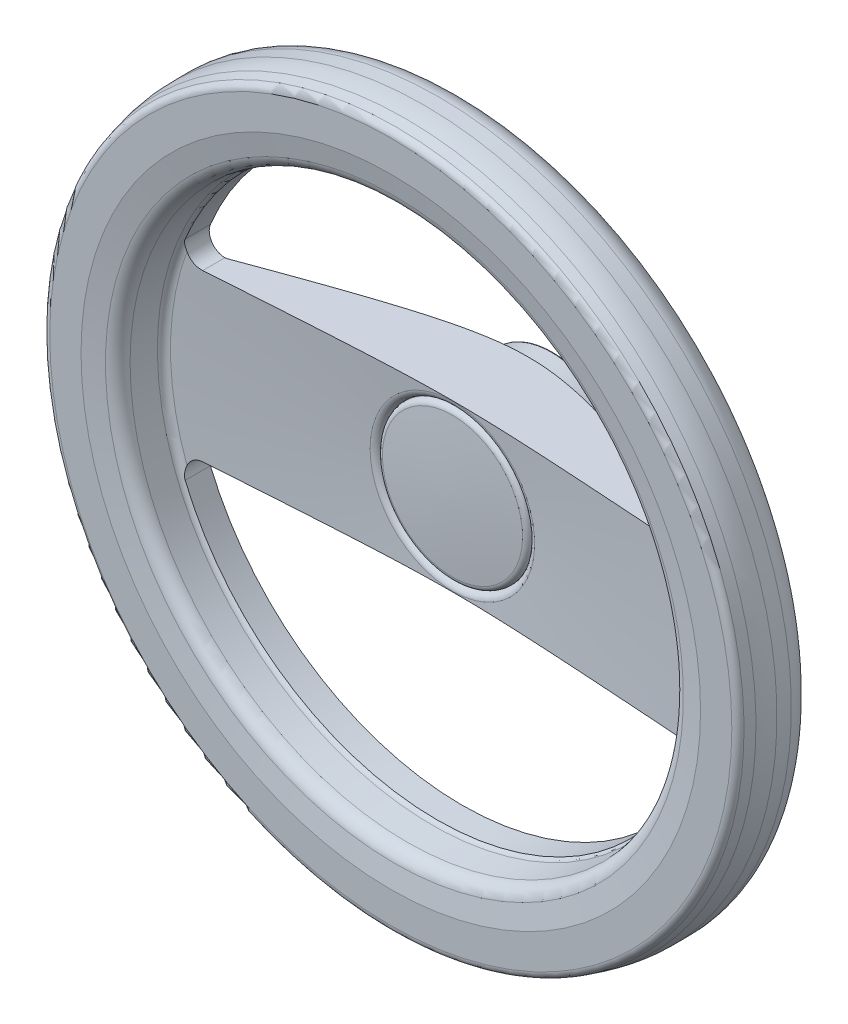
ISO-10303-21;
HEADER;
FILE_DESCRIPTION(('STEP AP214'),'2;1');
FILE_NAME('part.step','',(''),(''),'','','');
FILE_SCHEMA(('AUTOMOTIVE_DESIGN { 1 0 10303 214 1 1 1 1 }'));
ENDSEC;
DATA;
#1=APPLICATION_CONTEXT('core data for automotive mechanical design processes');
#2=APPLICATION_PROTOCOL_DEFINITION('international standard','automotive_design',2000,#1);
#3=PRODUCT_CONTEXT('',#1,'mechanical');
#4=PRODUCT('Part','Part','',(#3));
#5=PRODUCT_RELATED_PRODUCT_CATEGORY('part','',(#4));
#6=PRODUCT_DEFINITION_FORMATION('','',#4);
#7=PRODUCT_DEFINITION_CONTEXT('part definition',#1,'design');
#8=PRODUCT_DEFINITION('design','',#6,#7);
#9=PRODUCT_DEFINITION_SHAPE('','',#8);
#10=(LENGTH_UNIT() NAMED_UNIT(*) SI_UNIT(.MILLI.,.METRE.));
#11=(NAMED_UNIT(*) PLANE_ANGLE_UNIT() SI_UNIT($,.RADIAN.));
#12=(NAMED_UNIT(*) SI_UNIT($,.STERADIAN.) SOLID_ANGLE_UNIT());
#13=UNCERTAINTY_MEASURE_WITH_UNIT(LENGTH_MEASURE(1.E-05),#10,'distance_accuracy_value','');
#14=(GEOMETRIC_REPRESENTATION_CONTEXT(3) GLOBAL_UNCERTAINTY_ASSIGNED_CONTEXT((#13)) GLOBAL_UNIT_ASSIGNED_CONTEXT((#10,
#11,#12)) REPRESENTATION_CONTEXT('',''));
#15=CARTESIAN_POINT('',(0.,0.,0.));
#16=DIRECTION('',(0.,0.,1.));
#17=DIRECTION('',(1.,0.,0.));
#18=AXIS2_PLACEMENT_3D('',#15,#16,#17);
#19=CARTESIAN_POINT('',(0.,-6.30492075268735,-475.098415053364));
#20=DIRECTION('',(1.,0.,0.));
#21=DIRECTION('',(0.,1.,0.));
#22=AXIS2_PLACEMENT_3D('',#19,#20,#21);
#23=CIRCLE('',#22,527.136122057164);
#24=TRIMMED_CURVE('',#23,(PARAMETER_VALUE(-1.55883533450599)),
(PARAMETER_VALUE(1.55883533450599)),.T.,.PARAMETER.);
#25=CARTESIAN_POINT('',(0.,0.,-475.098415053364));
#26=DIRECTION('',(0.,0.,-1.));
#27=AXIS1_PLACEMENT('',#25,#26);
#28=SURFACE_OF_REVOLUTION('',#24,#27);
#29=CARTESIAN_POINT('',(0.,0.,51.9999999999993));
#30=VERTEX_POINT('',#29);
#31=VERTEX_LOOP('',#30);
#32=FACE_BOUND('',#31,.T.);
#33=CARTESIAN_POINT('',(0.,0.,50.2968932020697));
#34=DIRECTION('',(0.,0.,1.));
#35=DIRECTION('',(0.,-1.,0.));
#36=AXIS2_PLACEMENT_3D('',#33,#34,#35);
#37=CIRCLE('',#36,36.5);
#38=CARTESIAN_POINT('',(0.,-36.5,50.2968932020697));
#39=VERTEX_POINT('',#38);
#40=EDGE_CURVE('E873',#39,#39,#37,.F.);
#41=ORIENTED_EDGE('',*,*,#40,.T.);
#42=EDGE_LOOP('',(#41));
#43=FACE_BOUND('',#42,.T.);
#44=ADVANCED_FACE('F14',(#32,#43),#28,.T.);
#45=CARTESIAN_POINT('',(0.,0.,47.6484466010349));
#46=DIRECTION('',(0.,0.,1.));
#47=DIRECTION('',(0.,-1.,0.));
#48=AXIS2_PLACEMENT_3D('',#45,#46,#47);
#49=CYLINDRICAL_SURFACE('',#48,36.5);
#50=ORIENTED_EDGE('',*,*,#40,.F.);
#51=EDGE_LOOP('',(#50));
#52=FACE_BOUND('',#51,.T.);
#53=CARTESIAN_POINT('',(0.,0.,45.));
#54=DIRECTION('',(0.,0.,1.));
#55=DIRECTION('',(0.,-1.,0.));
#56=AXIS2_PLACEMENT_3D('',#53,#54,#55);
#57=CIRCLE('',#56,36.5);
#58=CARTESIAN_POINT('',(0.,-36.5,45.));
#59=VERTEX_POINT('',#58);
#60=EDGE_CURVE('E875',#59,#59,#57,.T.);
#61=ORIENTED_EDGE('',*,*,#60,.F.);
#62=EDGE_LOOP('',(#61));
#63=FACE_BOUND('',#62,.T.);
#64=ADVANCED_FACE('F1018',(#52,#63),#49,.F.);
#65=CARTESIAN_POINT('',(-38.25,0.,45.));
#66=DIRECTION('',(0.,0.,-1.));
#67=DIRECTION('',(0.,1.,0.));
#68=AXIS2_PLACEMENT_3D('',#65,#66,#67);
#69=PLANE('',#68);
#70=CARTESIAN_POINT('',(0.,0.,45.));
#71=DIRECTION('',(0.,0.,1.));
#72=DIRECTION('',(0.,-1.,0.));
#73=AXIS2_PLACEMENT_3D('',#70,#71,#72);
#74=CIRCLE('',#73,40.);
#75=CARTESIAN_POINT('',(0.,-40.,45.));
#76=VERTEX_POINT('',#75);
#77=EDGE_CURVE('E879',#76,#76,#74,.F.);
#78=ORIENTED_EDGE('',*,*,#77,.T.);
#79=EDGE_LOOP('',(#78));
#80=FACE_BOUND('',#79,.T.);
#81=ORIENTED_EDGE('',*,*,#60,.T.);
#82=EDGE_LOOP('',(#81));
#83=FACE_BOUND('',#82,.T.);
#84=ADVANCED_FACE('F1007',(#80,#83),#69,.T.);
#85=CARTESIAN_POINT('',(0.,0.,41.5));
#86=DIRECTION('',(0.,0.,1.));
#87=DIRECTION('',(0.,-1.,0.));
#88=AXIS2_PLACEMENT_3D('',#85,#86,#87);
#89=CYLINDRICAL_SURFACE('',#88,40.);
#90=ORIENTED_EDGE('',*,*,#77,.F.);
#91=EDGE_LOOP('',(#90));
#92=FACE_BOUND('',#91,.T.);
#93=CARTESIAN_POINT('',(0.,0.,38.));
#94=DIRECTION('',(0.,0.,1.));
#95=DIRECTION('',(0.,-1.,0.));
#96=AXIS2_PLACEMENT_3D('',#93,#94,#95);
#97=CIRCLE('',#96,40.);
#98=CARTESIAN_POINT('',(0.,-40.,38.));
#99=VERTEX_POINT('',#98);
#100=EDGE_CURVE('E884',#99,#99,#97,.T.);
#101=ORIENTED_EDGE('',*,*,#100,.F.);
#102=EDGE_LOOP('',(#101));
#103=FACE_BOUND('',#102,.T.);
#104=ADVANCED_FACE('F1005',(#92,#103),#89,.F.);
#105=CARTESIAN_POINT('',(-32.5,0.,38.));
#106=DIRECTION('',(0.,0.,1.));
#107=DIRECTION('',(0.,-1.,0.));
#108=AXIS2_PLACEMENT_3D('',#105,#106,#107);
#109=PLANE('',#108);
#110=CARTESIAN_POINT('',(0.,0.,38.));
#111=DIRECTION('',(0.,0.,1.));
#112=DIRECTION('',(0.,-1.,0.));
#113=AXIS2_PLACEMENT_3D('',#110,#111,#112);
#114=CIRCLE('',#113,25.);
#115=CARTESIAN_POINT('',(0.,-25.,38.));
#116=VERTEX_POINT('',#115);
#117=EDGE_CURVE('E998',#116,#116,#114,.T.);
#118=ORIENTED_EDGE('',*,*,#117,.F.);
#119=EDGE_LOOP('',(#118));
#120=FACE_BOUND('',#119,.T.);
#121=ORIENTED_EDGE('',*,*,#100,.T.);
#122=EDGE_LOOP('',(#121));
#123=FACE_BOUND('',#122,.T.);
#124=ADVANCED_FACE('F1003',(#120,#123),#109,.T.);
#125=CARTESIAN_POINT('',(0.,0.,40.5));
#126=DIRECTION('',(0.,0.,1.));
#127=DIRECTION('',(0.,-1.,0.));
#128=AXIS2_PLACEMENT_3D('',#125,#126,#127);
#129=CYLINDRICAL_SURFACE('',#128,25.);
#130=ORIENTED_EDGE('',*,*,#117,.T.);
#131=EDGE_LOOP('',(#130));
#132=FACE_BOUND('',#131,.T.);
#133=CARTESIAN_POINT('',(0.,0.,43.));
#134=DIRECTION('',(0.,0.,1.));
#135=DIRECTION('',(0.,-1.,0.));
#136=AXIS2_PLACEMENT_3D('',#133,#134,#135);
#137=CIRCLE('',#136,25.);
#138=CARTESIAN_POINT('',(0.,-25.,43.));
#139=VERTEX_POINT('',#138);
#140=EDGE_CURVE('E995',#139,#139,#137,.T.);
#141=ORIENTED_EDGE('',*,*,#140,.F.);
#142=EDGE_LOOP('',(#141));
#143=FACE_BOUND('',#142,.T.);
#144=ADVANCED_FACE('F1015',(#132,#143),#129,.T.);
#145=CARTESIAN_POINT('',(-19.375,0.,43.));
#146=DIRECTION('',(0.,0.,1.));
#147=DIRECTION('',(0.,-1.,0.));
#148=AXIS2_PLACEMENT_3D('',#145,#146,#147);
#149=PLANE('',#148);
#150=CARTESIAN_POINT('',(0.,0.,43.));
#151=DIRECTION('',(0.,0.,1.));
#152=DIRECTION('',(0.,-1.,0.));
#153=AXIS2_PLACEMENT_3D('',#150,#151,#152);
#154=CIRCLE('',#153,13.75);
#155=CARTESIAN_POINT('',(0.,-13.75,43.));
#156=VERTEX_POINT('',#155);
#157=EDGE_CURVE('E872',#156,#156,#154,.F.);
#158=ORIENTED_EDGE('',*,*,#157,.T.);
#159=EDGE_LOOP('',(#158));
#160=FACE_BOUND('',#159,.T.);
#161=ORIENTED_EDGE('',*,*,#140,.T.);
#162=EDGE_LOOP('',(#161));
#163=FACE_BOUND('',#162,.T.);
#164=ADVANCED_FACE('F1051',(#160,#163),#149,.T.);
#165=CARTESIAN_POINT('',(0.,0.,43.));
#166=DIRECTION('',(0.,0.,1.));
#167=DIRECTION('',(0.,-1.,0.));
#168=AXIS2_PLACEMENT_3D('',#165,#166,#167);
#169=CONICAL_SURFACE('',#168,13.75,0.785398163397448);
#170=ORIENTED_EDGE('',*,*,#157,.F.);
#171=EDGE_LOOP('',(#170));
#172=FACE_BOUND('',#171,.T.);
#173=CARTESIAN_POINT('',(0.,0.,42.25));
#174=DIRECTION('',(0.,0.,1.));
#175=DIRECTION('',(0.,-1.,0.));
#176=AXIS2_PLACEMENT_3D('',#173,#174,#175);
#177=CIRCLE('',#176,13.);
#178=CARTESIAN_POINT('',(0.,-13.,42.25));
#179=VERTEX_POINT('',#178);
#180=EDGE_CURVE('E870',#179,#179,#177,.F.);
#181=ORIENTED_EDGE('',*,*,#180,.T.);
#182=EDGE_LOOP('',(#181));
#183=FACE_BOUND('',#182,.T.);
#184=ADVANCED_FACE('F1061',(#172,#183),#169,.F.);
#185=CARTESIAN_POINT('',(0.,0.,21.225));
#186=DIRECTION('',(0.,0.,1.));
#187=DIRECTION('',(0.,-1.,0.));
#188=AXIS2_PLACEMENT_3D('',#185,#186,#187);
#189=CYLINDRICAL_SURFACE('',#188,13.);
#190=ORIENTED_EDGE('',*,*,#180,.F.);
#191=EDGE_LOOP('',(#190));
#192=FACE_BOUND('',#191,.T.);
#193=CARTESIAN_POINT('',(0.,0.,0.200000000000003));
#194=DIRECTION('',(0.,0.,-1.));
#195=DIRECTION('',(-1.,0.,0.));
#196=AXIS2_PLACEMENT_3D('',#193,#194,#195);
#197=CIRCLE('',#196,13.);
#198=CARTESIAN_POINT('',(-13.,0.,0.200000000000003));
#199=VERTEX_POINT('',#198);
#200=EDGE_CURVE('E861',#199,#199,#197,.T.);
#201=ORIENTED_EDGE('',*,*,#200,.T.);
#202=EDGE_LOOP('',(#201));
#203=FACE_BOUND('',#202,.T.);
#204=ADVANCED_FACE('F1071',(#192,#203),#189,.F.);
#205=CARTESIAN_POINT('',(0.,0.,0.));
#206=DIRECTION('',(0.,0.,-1.));
#207=DIRECTION('',(0.,1.,0.));
#208=AXIS2_PLACEMENT_3D('',#205,#206,#207);
#209=CONICAL_SURFACE('',#208,13.2,0.785398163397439);
#210=ORIENTED_EDGE('',*,*,#200,.F.);
#211=EDGE_LOOP('',(#210));
#212=FACE_BOUND('',#211,.T.);
#213=CARTESIAN_POINT('',(0.,0.,0.));
#214=DIRECTION('',(0.,0.,-1.));
#215=DIRECTION('',(0.,1.,0.));
#216=AXIS2_PLACEMENT_3D('',#213,#214,#215);
#217=CIRCLE('',#216,13.2);
#218=CARTESIAN_POINT('',(0.,13.2,0.));
#219=VERTEX_POINT('',#218);
#220=EDGE_CURVE('E869',#219,#219,#217,.F.);
#221=ORIENTED_EDGE('',*,*,#220,.F.);
#222=EDGE_LOOP('',(#221));
#223=FACE_BOUND('',#222,.T.);
#224=ADVANCED_FACE('F1081',(#212,#223),#209,.F.);
#225=CARTESIAN_POINT('',(-15.35,0.,0.));
#226=DIRECTION('',(0.,0.,-1.));
#227=DIRECTION('',(0.,1.,0.));
#228=AXIS2_PLACEMENT_3D('',#225,#226,#227);
#229=PLANE('',#228);
#230=CARTESIAN_POINT('',(0.,0.,0.));
#231=DIRECTION('',(0.,0.,1.));
#232=DIRECTION('',(0.,-1.,0.));
#233=AXIS2_PLACEMENT_3D('',#230,#231,#232);
#234=CIRCLE('',#233,17.5);
#235=CARTESIAN_POINT('',(0.,-17.5,0.));
#236=VERTEX_POINT('',#235);
#237=EDGE_CURVE('E988',#236,#236,#234,.T.);
#238=ORIENTED_EDGE('',*,*,#237,.F.);
#239=EDGE_LOOP('',(#238));
#240=FACE_BOUND('',#239,.T.);
#241=ORIENTED_EDGE('',*,*,#220,.T.);
#242=EDGE_LOOP('',(#241));
#243=FACE_BOUND('',#242,.T.);
#244=ADVANCED_FACE('F1091',(#240,#243),#229,.T.);
#245=CARTESIAN_POINT('',(0.,0.,0.1));
#246=DIRECTION('',(0.,0.,1.));
#247=DIRECTION('',(0.,-1.,0.));
#248=AXIS2_PLACEMENT_3D('',#245,#246,#247);
#249=CYLINDRICAL_SURFACE('',#248,17.5);
#250=ORIENTED_EDGE('',*,*,#237,.T.);
#251=EDGE_LOOP('',(#250));
#252=FACE_BOUND('',#251,.T.);
#253=CARTESIAN_POINT('',(0.,0.,0.200000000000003));
#254=DIRECTION('',(0.,0.,1.));
#255=DIRECTION('',(0.,-1.,0.));
#256=AXIS2_PLACEMENT_3D('',#253,#254,#255);
#257=CIRCLE('',#256,17.5);
#258=CARTESIAN_POINT('',(0.,-17.5,0.200000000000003));
#259=VERTEX_POINT('',#258);
#260=EDGE_CURVE('E985',#259,#259,#257,.T.);
#261=ORIENTED_EDGE('',*,*,#260,.F.);
#262=EDGE_LOOP('',(#261));
#263=FACE_BOUND('',#262,.T.);
#264=ADVANCED_FACE('F1101',(#252,#263),#249,.T.);
#265=CARTESIAN_POINT('',(-18.7586513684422,0.,0.2));
#266=DIRECTION('',(0.,0.,-1.));
#267=DIRECTION('',(0.,1.,0.));
#268=AXIS2_PLACEMENT_3D('',#265,#266,#267);
#269=PLANE('',#268);
#270=CARTESIAN_POINT('',(0.,0.,0.2));
#271=DIRECTION('',(0.,0.,1.));
#272=DIRECTION('',(0.,-1.,0.));
#273=AXIS2_PLACEMENT_3D('',#270,#271,#272);
#274=CIRCLE('',#273,20.0173027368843);
#275=CARTESIAN_POINT('',(0.,-20.0173027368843,0.200000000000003));
#276=VERTEX_POINT('',#275);
#277=CARTESIAN_POINT('',(0.,20.0173027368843,0.200000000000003));
#278=VERTEX_POINT('',#277);
#279=EDGE_CURVE('E839',#276,#278,#274,.T.);
#280=ORIENTED_EDGE('',*,*,#279,.F.);
#281=CARTESIAN_POINT('',(0.,0.,0.2));
#282=DIRECTION('',(0.,0.,1.));
#283=DIRECTION('',(-1.,0.,0.));
#284=AXIS2_PLACEMENT_3D('',#281,#282,#283);
#285=CIRCLE('',#284,20.0173027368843);
#286=CARTESIAN_POINT('',(-20.0173027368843,0.,0.2));
#287=VERTEX_POINT('',#286);
#288=EDGE_CURVE('E849',#287,#276,#285,.T.);
#289=ORIENTED_EDGE('',*,*,#288,.F.);
#290=CARTESIAN_POINT('',(0.,0.,0.2));
#291=DIRECTION('',(0.,0.,1.));
#292=DIRECTION('',(0.,1.,0.));
#293=AXIS2_PLACEMENT_3D('',#290,#291,#292);
#294=CIRCLE('',#293,20.0173027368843);
#295=EDGE_CURVE('E803',#278,#287,#294,.T.);
#296=ORIENTED_EDGE('',*,*,#295,.F.);
#297=EDGE_LOOP('',(#280,#289,#296));
#298=FACE_BOUND('',#297,.T.);
#299=ORIENTED_EDGE('',*,*,#260,.T.);
#300=EDGE_LOOP('',(#299));
#301=FACE_BOUND('',#300,.T.);
#302=ADVANCED_FACE('F816',(#298,#301),#269,.T.);
#303=CARTESIAN_POINT('',(0.,0.,1.2));
#304=DIRECTION('',(0.,0.,-1.));
#305=DIRECTION('',(0.,1.,0.));
#306=AXIS2_PLACEMENT_3D('',#303,#304,#305);
#307=TOROIDAL_SURFACE('',#306,20.0173027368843,1.);
#308=CARTESIAN_POINT('',(0.,0.,1.18254759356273));
#309=DIRECTION('',(0.,0.,1.));
#310=DIRECTION('',(-1.,0.,0.));
#311=AXIS2_PLACEMENT_3D('',#308,#309,#310);
#312=CIRCLE('',#311,21.0171504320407);
#313=CARTESIAN_POINT('',(-21.0171504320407,0.,1.18254759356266));
#314=VERTEX_POINT('',#313);
#315=EDGE_CURVE('E826',#314,#314,#312,.T.);
#316=ORIENTED_EDGE('',*,*,#315,.F.);
#317=EDGE_LOOP('',(#316));
#318=FACE_BOUND('',#317,.T.);
#319=ORIENTED_EDGE('',*,*,#279,.T.);
#320=ORIENTED_EDGE('',*,*,#295,.T.);
#321=ORIENTED_EDGE('',*,*,#288,.T.);
#322=EDGE_LOOP('',(#319,#320,#321));
#323=FACE_BOUND('',#322,.T.);
#324=ADVANCED_FACE('F806',(#318,#323),#307,.T.);
#325=CARTESIAN_POINT('',(0.,0.,29.2174524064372));
#326=DIRECTION('',(0.,0.,1.));
#327=DIRECTION('',(0.,-1.,0.));
#328=AXIS2_PLACEMENT_3D('',#325,#326,#327);
#329=CONICAL_SURFACE('',#328,21.5065015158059,0.0174532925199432);
#330=ORIENTED_EDGE('',*,*,#315,.T.);
#331=EDGE_LOOP('',(#330));
#332=FACE_BOUND('',#331,.T.);
#333=CARTESIAN_POINT('',(0.,0.,29.2174524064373));
#334=DIRECTION('',(0.,0.,-1.));
#335=DIRECTION('',(0.,1.,0.));
#336=AXIS2_PLACEMENT_3D('',#333,#334,#335);
#337=CIRCLE('',#336,21.5065015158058);
#338=CARTESIAN_POINT('',(0.,21.5065015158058,29.2174524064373));
#339=VERTEX_POINT('',#338);
#340=EDGE_CURVE('E1555',#339,#339,#337,.T.);
#341=ORIENTED_EDGE('',*,*,#340,.T.);
#342=EDGE_LOOP('',(#341));
#343=FACE_BOUND('',#342,.T.);
#344=ADVANCED_FACE('F772',(#332,#343),#329,.T.);
#345=CARTESIAN_POINT('',(0.,0.,29.2));
#346=DIRECTION('',(0.,0.,-1.));
#347=DIRECTION('',(0.,1.,0.));
#348=AXIS2_PLACEMENT_3D('',#345,#346,#347);
#349=TOROIDAL_SURFACE('',#348,22.5063492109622,1.);
#350=ORIENTED_EDGE('',*,*,#340,.F.);
#351=EDGE_LOOP('',(#350));
#352=FACE_BOUND('',#351,.T.);
#353=CARTESIAN_POINT('',(0.,0.,30.2));
#354=DIRECTION('',(0.,0.,-1.));
#355=DIRECTION('',(-1.,0.,0.));
#356=AXIS2_PLACEMENT_3D('',#353,#354,#355);
#357=CIRCLE('',#356,22.5063492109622);
#358=CARTESIAN_POINT('',(0.,22.5063492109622,30.2));
#359=VERTEX_POINT('',#358);
#360=CARTESIAN_POINT('',(-22.5063492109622,0.,30.2));
#361=VERTEX_POINT('',#360);
#362=EDGE_CURVE('E699',#359,#361,#357,.F.);
#363=ORIENTED_EDGE('',*,*,#362,.F.);
#364=CARTESIAN_POINT('',(0.,0.,30.2));
#365=DIRECTION('',(0.,0.,-1.));
#366=DIRECTION('',(0.,1.,0.));
#367=AXIS2_PLACEMENT_3D('',#364,#365,#366);
#368=CIRCLE('',#367,22.5063492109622);
#369=CARTESIAN_POINT('',(0.,-22.5063492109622,30.2));
#370=VERTEX_POINT('',#369);
#371=EDGE_CURVE('E719',#370,#359,#368,.F.);
#372=ORIENTED_EDGE('',*,*,#371,.F.);
#373=CARTESIAN_POINT('',(0.,0.,30.2));
#374=DIRECTION('',(0.,0.,-1.));
#375=DIRECTION('',(0.,-1.,0.));
#376=AXIS2_PLACEMENT_3D('',#373,#374,#375);
#377=CIRCLE('',#376,22.5063492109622);
#378=EDGE_CURVE('E709',#361,#370,#377,.F.);
#379=ORIENTED_EDGE('',*,*,#378,.F.);
#380=EDGE_LOOP('',(#363,#372,#379));
#381=FACE_BOUND('',#380,.T.);
#382=ADVANCED_FACE('F768',(#352,#381),#349,.F.);
#383=CARTESIAN_POINT('',(-26.,0.,30.2));
#384=DIRECTION('',(0.,0.,-1.));
#385=DIRECTION('',(1.,0.,0.));
#386=AXIS2_PLACEMENT_3D('',#383,#384,#385);
#387=PLANE('',#386);
#388=CARTESIAN_POINT('',(0.,0.,30.2));
#389=DIRECTION('',(0.,0.,1.));
#390=DIRECTION('',(0.,-1.,0.));
#391=AXIS2_PLACEMENT_3D('',#388,#389,#390);
#392=CIRCLE('',#391,29.4936507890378);
#393=CARTESIAN_POINT('',(0.,29.4936507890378,30.2));
#394=VERTEX_POINT('',#393);
#395=CARTESIAN_POINT('',(0.,-29.4936507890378,30.2));
#396=VERTEX_POINT('',#395);
#397=EDGE_CURVE('E693',#394,#396,#392,.F.);
#398=ORIENTED_EDGE('',*,*,#397,.T.);
#399=CARTESIAN_POINT('',(0.,0.,30.2));
#400=DIRECTION('',(0.,0.,1.));
#401=DIRECTION('',(-1.,0.,0.));
#402=AXIS2_PLACEMENT_3D('',#399,#400,#401);
#403=CIRCLE('',#402,29.4936507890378);
#404=CARTESIAN_POINT('',(-29.4936507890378,0.,30.2));
#405=VERTEX_POINT('',#404);
#406=EDGE_CURVE('E748',#396,#405,#403,.F.);
#407=ORIENTED_EDGE('',*,*,#406,.T.);
#408=CARTESIAN_POINT('',(0.,0.,30.2));
#409=DIRECTION('',(0.,0.,1.));
#410=DIRECTION('',(0.,1.,0.));
#411=AXIS2_PLACEMENT_3D('',#408,#409,#410);
#412=CIRCLE('',#411,29.4936507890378);
#413=EDGE_CURVE('E663',#405,#394,#412,.F.);
#414=ORIENTED_EDGE('',*,*,#413,.T.);
#415=EDGE_LOOP('',(#398,#407,#414));
#416=FACE_BOUND('',#415,.T.);
#417=ORIENTED_EDGE('',*,*,#378,.T.);
#418=ORIENTED_EDGE('',*,*,#371,.T.);
#419=ORIENTED_EDGE('',*,*,#362,.T.);
#420=EDGE_LOOP('',(#417,#418,#419));
#421=FACE_BOUND('',#420,.T.);
#422=ADVANCED_FACE('F680',(#416,#421),#387,.T.);
#423=CARTESIAN_POINT('',(0.,0.,29.2));
#424=DIRECTION('',(0.,0.,-1.));
#425=DIRECTION('',(0.,1.,0.));
#426=AXIS2_PLACEMENT_3D('',#423,#424,#425);
#427=TOROIDAL_SURFACE('',#426,29.4936507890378,1.);
#428=ORIENTED_EDGE('',*,*,#397,.F.);
#429=ORIENTED_EDGE('',*,*,#413,.F.);
#430=ORIENTED_EDGE('',*,*,#406,.F.);
#431=EDGE_LOOP('',(#428,#429,#430));
#432=FACE_BOUND('',#431,.T.);
#433=CARTESIAN_POINT('',(0.,0.,29.2174524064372));
#434=DIRECTION('',(0.,0.,-1.));
#435=DIRECTION('',(-1.,0.,0.));
#436=AXIS2_PLACEMENT_3D('',#433,#434,#435);
#437=CIRCLE('',#436,30.4934984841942);
#438=CARTESIAN_POINT('',(-30.4934984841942,0.,29.2174524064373));
#439=VERTEX_POINT('',#438);
#440=EDGE_CURVE('E690',#439,#439,#437,.T.);
#441=ORIENTED_EDGE('',*,*,#440,.T.);
#442=EDGE_LOOP('',(#441));
#443=FACE_BOUND('',#442,.T.);
#444=ADVANCED_FACE('F669',(#432,#443),#427,.F.);
#445=CARTESIAN_POINT('',(0.,0.,1.18254759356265));
#446=DIRECTION('',(0.,0.,-1.));
#447=DIRECTION('',(0.,1.,0.));
#448=AXIS2_PLACEMENT_3D('',#445,#446,#447);
#449=CONICAL_SURFACE('',#448,30.9828495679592,0.0174532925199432);
#450=CARTESIAN_POINT('',(0.,0.,1.18254759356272));
#451=DIRECTION('',(0.,0.,-1.));
#452=DIRECTION('',(0.,1.,0.));
#453=AXIS2_PLACEMENT_3D('',#450,#451,#452);
#454=CIRCLE('',#453,30.9828495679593);
#455=CARTESIAN_POINT('',(0.,30.9828495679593,1.18254759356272));
#456=VERTEX_POINT('',#455);
#457=EDGE_CURVE('E689',#456,#456,#454,.F.);
#458=ORIENTED_EDGE('',*,*,#457,.F.);
#459=EDGE_LOOP('',(#458));
#460=FACE_BOUND('',#459,.T.);
#461=ORIENTED_EDGE('',*,*,#440,.F.);
#462=EDGE_LOOP('',(#461));
#463=FACE_BOUND('',#462,.T.);
#464=ADVANCED_FACE('F679',(#460,#463),#449,.F.);
#465=CARTESIAN_POINT('',(0.,-6.30492075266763,-472.098415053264));
#466=DIRECTION('',(1.,0.,0.));
#467=DIRECTION('',(0.,1.,0.));
#468=AXIS2_PLACEMENT_3D('',#465,#466,#467);
#469=CIRCLE('',#468,527.136122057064);
#470=TRIMMED_CURVE('',#469,(PARAMETER_VALUE(-1.55883533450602)),
(PARAMETER_VALUE(1.55883533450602)),.T.,.PARAMETER.);
#471=CARTESIAN_POINT('',(0.,0.,-472.098415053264));
#472=DIRECTION('',(0.,0.,-1.));
#473=AXIS1_PLACEMENT('',#471,#472);
#474=SURFACE_OF_REVOLUTION('',#470,#473);
#475=CARTESIAN_POINT('',(0.,0.,53.2354274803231));
#476=DIRECTION('',(0.,0.,-1.));
#477=DIRECTION('',(0.,1.,0.));
#478=AXIS2_PLACEMENT_3D('',#475,#476,#477);
#479=CIRCLE('',#478,37.2478640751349);
#480=CARTESIAN_POINT('',(0.,37.2478640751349,53.2354274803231));
#481=VERTEX_POINT('',#480);
#482=EDGE_CURVE('E976',#481,#481,#479,.T.);
#483=ORIENTED_EDGE('',*,*,#482,.F.);
#484=EDGE_LOOP('',(#483));
#485=FACE_BOUND('',#484,.T.);
#486=CARTESIAN_POINT('',(0.,0.,55.));
#487=VERTEX_POINT('',#486);
#488=VERTEX_LOOP('',#487);
#489=FACE_BOUND('',#488,.T.);
#490=ADVANCED_FACE('F625',(#485,#489),#474,.F.);
#491=CARTESIAN_POINT('',(0.,0.,1.2));
#492=DIRECTION('',(0.,0.,-1.));
#493=DIRECTION('',(0.,1.,0.));
#494=AXIS2_PLACEMENT_3D('',#491,#492,#493);
#495=TOROIDAL_SURFACE('',#494,31.9826972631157,1.);
#496=CARTESIAN_POINT('',(0.,0.,0.2));
#497=DIRECTION('',(0.,0.,-1.));
#498=DIRECTION('',(-1.,0.,0.));
#499=AXIS2_PLACEMENT_3D('',#496,#497,#498);
#500=CIRCLE('',#499,31.9826972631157);
#501=CARTESIAN_POINT('',(0.,31.9826972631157,0.200000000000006));
#502=VERTEX_POINT('',#501);
#503=CARTESIAN_POINT('',(-31.9826972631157,0.,0.200000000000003));
#504=VERTEX_POINT('',#503);
#505=EDGE_CURVE('E648',#502,#504,#500,.F.);
#506=ORIENTED_EDGE('',*,*,#505,.F.);
#507=CARTESIAN_POINT('',(0.,0.,0.2));
#508=DIRECTION('',(0.,0.,-1.));
#509=DIRECTION('',(0.,1.,0.));
#510=AXIS2_PLACEMENT_3D('',#507,#508,#509);
#511=CIRCLE('',#510,31.9826972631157);
#512=CARTESIAN_POINT('',(0.,-31.9826972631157,0.200000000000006));
#513=VERTEX_POINT('',#512);
#514=EDGE_CURVE('E924',#513,#502,#511,.F.);
#515=ORIENTED_EDGE('',*,*,#514,.F.);
#516=CARTESIAN_POINT('',(0.,0.,0.2));
#517=DIRECTION('',(0.,0.,-1.));
#518=DIRECTION('',(0.,-1.,0.));
#519=AXIS2_PLACEMENT_3D('',#516,#517,#518);
#520=CIRCLE('',#519,31.9826972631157);
#521=EDGE_CURVE('E978',#504,#513,#520,.F.);
#522=ORIENTED_EDGE('',*,*,#521,.F.);
#523=EDGE_LOOP('',(#506,#515,#522));
#524=FACE_BOUND('',#523,.T.);
#525=ORIENTED_EDGE('',*,*,#457,.T.);
#526=EDGE_LOOP('',(#525));
#527=FACE_BOUND('',#526,.T.);
#528=ADVANCED_FACE('F619',(#524,#527),#495,.T.);
#529=CARTESIAN_POINT('',(-172.886733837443,0.,86.));
#530=DIRECTION('',(0.,0.,1.));
#531=DIRECTION('',(0.,-1.,0.));
#532=AXIS2_PLACEMENT_3D('',#529,#530,#531);
#533=PLANE('',#532);
#534=CARTESIAN_POINT('',(0.,0.,86.));
#535=DIRECTION('',(0.,0.,1.));
#536=DIRECTION('',(0.,-1.,0.));
#537=AXIS2_PLACEMENT_3D('',#534,#535,#536);
#538=CIRCLE('',#537,164.583333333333);
#539=CARTESIAN_POINT('',(0.,-164.583333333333,86.));
#540=VERTEX_POINT('',#539);
#541=EDGE_CURVE('E974',#540,#540,#538,.F.);
#542=ORIENTED_EDGE('',*,*,#541,.T.);
#543=EDGE_LOOP('',(#542));
#544=FACE_BOUND('',#543,.T.);
#545=CARTESIAN_POINT('',(0.,0.,86.));
#546=DIRECTION('',(0.,0.,-1.));
#547=DIRECTION('',(0.,-1.,0.));
#548=AXIS2_PLACEMENT_3D('',#545,#546,#547);
#549=CIRCLE('',#548,181.190134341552);
#550=CARTESIAN_POINT('',(0.,-181.190134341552,86.));
#551=VERTEX_POINT('',#550);
#552=CARTESIAN_POINT('',(-181.190134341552,0.,86.));
#553=VERTEX_POINT('',#552);
#554=EDGE_CURVE('E920',#551,#553,#549,.T.);
#555=ORIENTED_EDGE('',*,*,#554,.F.);
#556=CARTESIAN_POINT('',(0.,0.,86.));
#557=DIRECTION('',(0.,0.,-1.));
#558=DIRECTION('',(0.,1.,0.));
#559=AXIS2_PLACEMENT_3D('',#556,#557,#558);
#560=CIRCLE('',#559,181.190134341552);
#561=CARTESIAN_POINT('',(0.,181.190134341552,86.));
#562=VERTEX_POINT('',#561);
#563=EDGE_CURVE('E911',#562,#551,#560,.T.);
#564=ORIENTED_EDGE('',*,*,#563,.F.);
#565=CARTESIAN_POINT('',(0.,0.,86.));
#566=DIRECTION('',(0.,0.,-1.));
#567=DIRECTION('',(-1.,0.,0.));
#568=AXIS2_PLACEMENT_3D('',#565,#566,#567);
#569=CIRCLE('',#568,181.190134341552);
#570=EDGE_CURVE('E921',#553,#562,#569,.T.);
#571=ORIENTED_EDGE('',*,*,#570,.F.);
#572=EDGE_LOOP('',(#555,#564,#571));
#573=FACE_BOUND('',#572,.T.);
#574=ADVANCED_FACE('F624',(#544,#573),#533,.T.);
#575=CARTESIAN_POINT('',(0.,0.,50.245684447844));
#576=DIRECTION('',(0.,0.,-1.));
#577=DIRECTION('',(0.,1.,0.));
#578=AXIS2_PLACEMENT_3D('',#575,#576,#577);
#579=TOROIDAL_SURFACE('',#578,37.,3.);
#580=ORIENTED_EDGE('',*,*,#482,.T.);
#581=EDGE_LOOP('',(#580));
#582=FACE_BOUND('',#581,.T.);
#583=CARTESIAN_POINT('',(0.,0.,50.245684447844));
#584=DIRECTION('',(0.,0.,1.));
#585=DIRECTION('',(0.,-1.,0.));
#586=AXIS2_PLACEMENT_3D('',#583,#584,#585);
#587=CIRCLE('',#586,40.);
#588=CARTESIAN_POINT('',(0.,-40.,50.245684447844));
#589=VERTEX_POINT('',#588);
#590=EDGE_CURVE('E954',#589,#589,#587,.F.);
#591=ORIENTED_EDGE('',*,*,#590,.F.);
#592=EDGE_LOOP('',(#591));
#593=FACE_BOUND('',#592,.T.);
#594=ADVANCED_FACE('F956',(#582,#593),#579,.T.);
#595=CARTESIAN_POINT('',(0.,0.,86.));
#596=DIRECTION('',(0.,0.,1.));
#597=DIRECTION('',(0.,-1.,0.));
#598=AXIS2_PLACEMENT_3D('',#595,#596,#597);
#599=CONICAL_SURFACE('',#598,164.583333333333,1.39626340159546);
#600=CARTESIAN_POINT('',(0.,0.,84.0516598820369));
#601=DIRECTION('',(0.,0.,-1.));
#602=DIRECTION('',(0.,1.,0.));
#603=AXIS2_PLACEMENT_3D('',#600,#601,#602);
#604=CIRCLE('',#603,153.533747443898);
#605=CARTESIAN_POINT('',(0.,153.533747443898,84.0516598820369));
#606=VERTEX_POINT('',#605);
#607=EDGE_CURVE('E971',#606,#606,#604,.F.);
#608=ORIENTED_EDGE('',*,*,#607,.F.);
#609=EDGE_LOOP('',(#608));
#610=FACE_BOUND('',#609,.T.);
#611=ORIENTED_EDGE('',*,*,#541,.F.);
#612=EDGE_LOOP('',(#611));
#613=FACE_BOUND('',#612,.T.);
#614=ADVANCED_FACE('F958',(#610,#613),#599,.F.);
#615=CARTESIAN_POINT('',(-35.7413486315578,0.,0.2));
#616=DIRECTION('',(0.,0.,-1.));
#617=DIRECTION('',(1.,0.,0.));
#618=AXIS2_PLACEMENT_3D('',#615,#616,#617);
#619=PLANE('',#618);
#620=CARTESIAN_POINT('',(0.,0.,0.2));
#621=DIRECTION('',(0.,0.,1.));
#622=DIRECTION('',(0.,-1.,0.));
#623=AXIS2_PLACEMENT_3D('',#620,#621,#622);
#624=CIRCLE('',#623,39.5);
#625=CARTESIAN_POINT('',(0.,-39.5,0.200000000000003));
#626=VERTEX_POINT('',#625);
#627=CARTESIAN_POINT('',(0.,39.5,0.200000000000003));
#628=VERTEX_POINT('',#627);
#629=EDGE_CURVE('E899',#626,#628,#624,.T.);
#630=ORIENTED_EDGE('',*,*,#629,.F.);
#631=CARTESIAN_POINT('',(0.,0.,0.2));
#632=DIRECTION('',(0.,0.,1.));
#633=DIRECTION('',(-1.,0.,0.));
#634=AXIS2_PLACEMENT_3D('',#631,#632,#633);
#635=CIRCLE('',#634,39.5);
#636=CARTESIAN_POINT('',(-39.5,0.,0.2));
#637=VERTEX_POINT('',#636);
#638=EDGE_CURVE('E1468',#637,#626,#635,.T.);
#639=ORIENTED_EDGE('',*,*,#638,.F.);
#640=CARTESIAN_POINT('',(0.,0.,0.2));
#641=DIRECTION('',(0.,0.,1.));
#642=DIRECTION('',(0.,1.,0.));
#643=AXIS2_PLACEMENT_3D('',#640,#641,#642);
#644=CIRCLE('',#643,39.5);
#645=EDGE_CURVE('E1448',#628,#637,#644,.T.);
#646=ORIENTED_EDGE('',*,*,#645,.F.);
#647=EDGE_LOOP('',(#630,#639,#646));
#648=FACE_BOUND('',#647,.T.);
#649=ORIENTED_EDGE('',*,*,#521,.T.);
#650=ORIENTED_EDGE('',*,*,#514,.T.);
#651=ORIENTED_EDGE('',*,*,#505,.T.);
#652=EDGE_LOOP('',(#649,#650,#651));
#653=FACE_BOUND('',#652,.T.);
#654=ADVANCED_FACE('F593',(#648,#653),#619,.T.);
#655=CARTESIAN_POINT('',(0.,0.,82.2));
#656=DIRECTION('',(0.,0.,-1.));
#657=DIRECTION('',(0.,1.,0.));
#658=AXIS2_PLACEMENT_3D('',#655,#656,#657);
#659=TOROIDAL_SURFACE('',#658,181.190134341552,3.8);
#660=CARTESIAN_POINT('',(0.,0.,83.1835123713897));
#661=DIRECTION('',(0.,0.,-1.));
#662=DIRECTION('',(-1.,0.,0.));
#663=AXIS2_PLACEMENT_3D('',#660,#661,#662);
#664=CIRCLE('',#663,184.860652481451);
#665=CARTESIAN_POINT('',(-184.860652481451,0.,83.1835123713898));
#666=VERTEX_POINT('',#665);
#667=EDGE_CURVE('E583',#666,#666,#664,.T.);
#668=ORIENTED_EDGE('',*,*,#667,.F.);
#669=EDGE_LOOP('',(#668));
#670=FACE_BOUND('',#669,.T.);
#671=ORIENTED_EDGE('',*,*,#554,.T.);
#672=ORIENTED_EDGE('',*,*,#570,.T.);
#673=ORIENTED_EDGE('',*,*,#563,.T.);
#674=EDGE_LOOP('',(#671,#672,#673));
#675=FACE_BOUND('',#674,.T.);
#676=ADVANCED_FACE('F588',(#670,#675),#659,.T.);
#677=CARTESIAN_POINT('',(0.,0.,49.7624832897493));
#678=DIRECTION('',(0.,0.,1.));
#679=DIRECTION('',(0.,-1.,0.));
#680=AXIS2_PLACEMENT_3D('',#677,#678,#679);
#681=CYLINDRICAL_SURFACE('',#680,40.);
#682=ORIENTED_EDGE('',*,*,#590,.T.);
#683=EDGE_LOOP('',(#682));
#684=FACE_BOUND('',#683,.T.);
#685=CARTESIAN_POINT('',(0.,0.,49.2792821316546));
#686=DIRECTION('',(0.,0.,-1.));
#687=DIRECTION('',(0.,1.,0.));
#688=AXIS2_PLACEMENT_3D('',#685,#686,#687);
#689=CIRCLE('',#688,40.);
#690=CARTESIAN_POINT('',(0.,40.,49.2792821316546));
#691=VERTEX_POINT('',#690);
#692=EDGE_CURVE('E578',#691,#691,#689,.T.);
#693=ORIENTED_EDGE('',*,*,#692,.F.);
#694=EDGE_LOOP('',(#693));
#695=FACE_BOUND('',#694,.T.);
#696=ADVANCED_FACE('F592',(#684,#695),#681,.T.);
#697=CARTESIAN_POINT('',(0.,0.,76.5671209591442));
#698=DIRECTION('',(0.,0.,-1.));
#699=DIRECTION('',(0.,1.,0.));
#700=AXIS2_PLACEMENT_3D('',#697,#698,#699);
#701=TOROIDAL_SURFACE('',#700,154.853473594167,7.6);
#702=CARTESIAN_POINT('',(0.,0.,77.2295046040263));
#703=DIRECTION('',(0.,0.,1.));
#704=DIRECTION('',(-1.,0.,0.));
#705=AXIS2_PLACEMENT_3D('',#702,#703,#704);
#706=CIRCLE('',#705,147.282393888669);
#707=CARTESIAN_POINT('',(-147.282393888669,0.,77.2295046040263));
#708=VERTEX_POINT('',#707);
#709=EDGE_CURVE('E576',#708,#708,#706,.F.);
#710=ORIENTED_EDGE('',*,*,#709,.T.);
#711=EDGE_LOOP('',(#710));
#712=FACE_BOUND('',#711,.T.);
#713=ORIENTED_EDGE('',*,*,#607,.T.);
#714=EDGE_LOOP('',(#713));
#715=FACE_BOUND('',#714,.T.);
#716=ADVANCED_FACE('F564',(#712,#715),#701,.T.);
#717=CARTESIAN_POINT('',(0.,0.,0.7));
#718=DIRECTION('',(0.,0.,-1.));
#719=DIRECTION('',(0.,1.,0.));
#720=AXIS2_PLACEMENT_3D('',#717,#718,#719);
#721=TOROIDAL_SURFACE('',#720,39.5,0.5);
#722=ORIENTED_EDGE('',*,*,#629,.T.);
#723=ORIENTED_EDGE('',*,*,#645,.T.);
#724=ORIENTED_EDGE('',*,*,#638,.T.);
#725=EDGE_LOOP('',(#722,#723,#724));
#726=FACE_BOUND('',#725,.T.);
#727=CARTESIAN_POINT('',(0.,0.,0.7));
#728=DIRECTION('',(0.,0.,1.));
#729=DIRECTION('',(0.,-1.,0.));
#730=AXIS2_PLACEMENT_3D('',#727,#728,#729);
#731=CIRCLE('',#730,40.);
#732=CARTESIAN_POINT('',(0.,-40.,0.7));
#733=VERTEX_POINT('',#732);
#734=EDGE_CURVE('E573',#733,#733,#731,.T.);
#735=ORIENTED_EDGE('',*,*,#734,.F.);
#736=EDGE_LOOP('',(#735));
#737=FACE_BOUND('',#736,.T.);
#738=ADVANCED_FACE('F559',(#726,#737),#721,.T.);
#739=CARTESIAN_POINT('',(0.,0.,78.165662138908));
#740=DIRECTION('',(0.,0.,-1.));
#741=DIRECTION('',(0.,1.,0.));
#742=AXIS2_PLACEMENT_3D('',#739,#740,#741);
#743=CONICAL_SURFACE('',#742,186.205181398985,0.261799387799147);
#744=CARTESIAN_POINT('',(0.,0.,78.1656621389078));
#745=DIRECTION('',(0.,0.,-1.));
#746=DIRECTION('',(0.,1.,0.));
#747=AXIS2_PLACEMENT_3D('',#744,#745,#746);
#748=CIRCLE('',#747,186.205181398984);
#749=CARTESIAN_POINT('',(0.,186.205181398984,78.1656621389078));
#750=VERTEX_POINT('',#749);
#751=EDGE_CURVE('E528',#750,#750,#748,.T.);
#752=ORIENTED_EDGE('',*,*,#751,.F.);
#753=EDGE_LOOP('',(#752));
#754=FACE_BOUND('',#753,.T.);
#755=ORIENTED_EDGE('',*,*,#667,.T.);
#756=EDGE_LOOP('',(#755));
#757=FACE_BOUND('',#756,.T.);
#758=ADVANCED_FACE('F555',(#754,#757),#743,.T.);
#759=CARTESIAN_POINT('',(0.,0.,49.2792821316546));
#760=DIRECTION('',(0.,0.,-1.));
#761=DIRECTION('',(0.,1.,0.));
#762=AXIS2_PLACEMENT_3D('',#759,#760,#761);
#763=TOROIDAL_SURFACE('',#762,44.,4.);
#764=CARTESIAN_POINT('',(0.,0.,53.2688278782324));
#765=DIRECTION('',(0.,0.,1.));
#766=DIRECTION('',(-1.,0.,0.));
#767=AXIS2_PLACEMENT_3D('',#764,#765,#766);
#768=CIRCLE('',#767,43.7109935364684);
#769=CARTESIAN_POINT('',(-43.7109935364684,0.,53.2688278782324));
#770=VERTEX_POINT('',#769);
#771=EDGE_CURVE('E527',#770,#770,#768,.T.);
#772=ORIENTED_EDGE('',*,*,#771,.T.);
#773=EDGE_LOOP('',(#772));
#774=FACE_BOUND('',#773,.T.);
#775=ORIENTED_EDGE('',*,*,#692,.T.);
#776=EDGE_LOOP('',(#775));
#777=FACE_BOUND('',#776,.T.);
#778=ADVANCED_FACE('F550',(#774,#777),#763,.T.);
#779=CARTESIAN_POINT('',(0.,0.,77.2295046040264));
#780=DIRECTION('',(0.,0.,1.));
#781=DIRECTION('',(0.,-1.,0.));
#782=AXIS2_PLACEMENT_3D('',#779,#780,#781);
#783=CONICAL_SURFACE('',#782,147.282393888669,0.0872664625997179);
#784=CARTESIAN_POINT('',(0.,0.,63.8916434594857));
#785=DIRECTION('',(0.,0.,-1.));
#786=DIRECTION('',(0.,1.,0.));
#787=AXIS2_PLACEMENT_3D('',#784,#785,#786);
#788=CIRCLE('',#787,146.11548224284);
#789=CARTESIAN_POINT('',(0.,146.11548224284,63.8916434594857));
#790=VERTEX_POINT('',#789);
#791=EDGE_CURVE('E519',#790,#790,#788,.T.);
#792=ORIENTED_EDGE('',*,*,#791,.T.);
#793=EDGE_LOOP('',(#792));
#794=FACE_BOUND('',#793,.T.);
#795=ORIENTED_EDGE('',*,*,#709,.F.);
#796=EDGE_LOOP('',(#795));
#797=FACE_BOUND('',#796,.T.);
#798=ADVANCED_FACE('F554',(#794,#797),#783,.F.);
#799=CARTESIAN_POINT('',(0.,0.,6.1));
#800=DIRECTION('',(0.,0.,1.));
#801=DIRECTION('',(0.,-1.,0.));
#802=AXIS2_PLACEMENT_3D('',#799,#800,#801);
#803=CYLINDRICAL_SURFACE('',#802,40.);
#804=CARTESIAN_POINT('',(0.,0.,11.5));
#805=DIRECTION('',(0.,0.,1.));
#806=DIRECTION('',(-1.,0.,0.));
#807=AXIS2_PLACEMENT_3D('',#804,#805,#806);
#808=CIRCLE('',#807,40.);
#809=CARTESIAN_POINT('',(-40.,0.,11.5));
#810=VERTEX_POINT('',#809);
#811=EDGE_CURVE('E203',#810,#810,#808,.T.);
#812=ORIENTED_EDGE('',*,*,#811,.F.);
#813=EDGE_LOOP('',(#812));
#814=FACE_BOUND('',#813,.T.);
#815=ORIENTED_EDGE('',*,*,#734,.T.);
#816=EDGE_LOOP('',(#815));
#817=FACE_BOUND('',#816,.T.);
#818=ADVANCED_FACE('F1187',(#814,#817),#803,.T.);
#819=CARTESIAN_POINT('',(0.,0.,68.3305384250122));
#820=DIRECTION('',(0.,0.,-1.));
#821=DIRECTION('',(0.,1.,0.));
#822=AXIS2_PLACEMENT_3D('',#819,#820,#821);
#823=TOROIDAL_SURFACE('',#822,149.5,37.9999999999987);
#824=ORIENTED_EDGE('',*,*,#751,.T.);
#825=EDGE_LOOP('',(#824));
#826=FACE_BOUND('',#825,.T.);
#827=CARTESIAN_POINT('',(0.,0.,68.3305384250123));
#828=DIRECTION('',(0.,0.,1.));
#829=DIRECTION('',(0.,-1.,0.));
#830=AXIS2_PLACEMENT_3D('',#827,#828,#829);
#831=CIRCLE('',#830,187.5);
#832=CARTESIAN_POINT('',(0.,-187.5,68.3305384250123));
#833=VERTEX_POINT('',#832);
#834=EDGE_CURVE('E360',#833,#833,#831,.F.);
#835=ORIENTED_EDGE('',*,*,#834,.F.);
#836=EDGE_LOOP('',(#835));
#837=FACE_BOUND('',#836,.T.);
#838=ADVANCED_FACE('F377',(#826,#837),#823,.T.);
#839=CARTESIAN_POINT('',(0.,0.,60.4327668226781));
#840=DIRECTION('',(0.,0.,1.));
#841=DIRECTION('',(0.,-1.,0.));
#842=AXIS2_PLACEMENT_3D('',#839,#840,#841);
#843=CONICAL_SURFACE('',#842,142.604498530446,1.49848170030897);
#844=ORIENTED_EDGE('',*,*,#771,.F.);
#845=EDGE_LOOP('',(#844));
#846=FACE_BOUND('',#845,.T.);
#847=CARTESIAN_POINT('',(126.126731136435,-44.,59.7791147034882));
#848=CARTESIAN_POINT('',(126.361744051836,-43.9999750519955,59.7951889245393));
#849=CARTESIAN_POINT('',(126.596736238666,-44.0099405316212,59.8115043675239));
#850=CARTESIAN_POINT('',(127.065005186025,-44.0496635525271,59.8444936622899));
#851=CARTESIAN_POINT('',(127.298282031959,-44.0794201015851,59.861167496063));
#852=CARTESIAN_POINT('',(127.76129842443,-44.1585071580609,59.8947387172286));
#853=CARTESIAN_POINT('',(127.991040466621,-44.2078231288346,59.9116359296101));
#854=CARTESIAN_POINT('',(128.445531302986,-44.3256673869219,59.9455430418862));
#855=CARTESIAN_POINT('',(128.670280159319,-44.3941954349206,59.9625529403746));
#856=CARTESIAN_POINT('',(129.113274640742,-44.5500078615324,59.996570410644));
#857=CARTESIAN_POINT('',(129.331517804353,-44.637299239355,60.0135779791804));
#858=CARTESIAN_POINT('',(129.759866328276,-44.8300055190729,60.0474649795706));
#859=CARTESIAN_POINT('',(129.969971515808,-44.9354208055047,60.0643444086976));
#860=CARTESIAN_POINT('',(130.38054486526,-45.1636279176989,60.0978576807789));
#861=CARTESIAN_POINT('',(130.581012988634,-45.2864198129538,60.1144915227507));
#862=CARTESIAN_POINT('',(130.97087748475,-45.5485076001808,60.1473992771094));
#863=CARTESIAN_POINT('',(131.160274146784,-45.6878030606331,60.1636731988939));
#864=CARTESIAN_POINT('',(131.526722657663,-45.9819741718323,60.195758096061));
#865=CARTESIAN_POINT('',(131.703769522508,-46.1368560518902,60.2115688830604));
#866=CARTESIAN_POINT('',(132.04416308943,-46.4610522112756,60.2426147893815));
#867=CARTESIAN_POINT('',(132.207510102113,-46.6303661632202,60.2578499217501));
#868=CARTESIAN_POINT('',(132.5192397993,-46.9821214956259,60.287635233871));
#869=CARTESIAN_POINT('',(132.667631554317,-47.1645548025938,60.3021858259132));
#870=CARTESIAN_POINT('',(132.948448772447,-47.5412777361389,60.3305121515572));
#871=CARTESIAN_POINT('',(133.080879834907,-47.7355631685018,60.3442881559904));
#872=CARTESIAN_POINT('',(133.32994724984,-48.1364003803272,60.3710970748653));
#873=CARTESIAN_POINT('',(133.446437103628,-48.3430437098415,60.3841225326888));
#874=CARTESIAN_POINT('',(133.661218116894,-48.7651357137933,60.4091924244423));
#875=CARTESIAN_POINT('',(133.75954379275,-48.9805667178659,60.4212386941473));
#876=CARTESIAN_POINT('',(133.848494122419,-49.199833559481,60.4327668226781));
#877=B_SPLINE_CURVE_WITH_KNOTS('',3,(#847,#848,#849,#850,#851,#852,#853,#854,#855,#856,#857,
#858,#859,#860,#861,#862,#863,#864,#865,#866,#867,#868,#869,#870,#871,#872,#873,#874,#875,#876),
.UNSPECIFIED.,.F.,.F.,(4,2,2,2,2,2,2,2,2,2,2,2,2,2,4),(0.,0.706469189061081,1.41290296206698,
2.11881269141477,2.82471362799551,3.53087834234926,4.23705804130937,4.94324056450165,
5.64940462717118,6.35585204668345,7.06228344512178,7.76828377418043,8.47403569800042,
9.18589103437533,9.89637943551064),.UNSPECIFIED.);
#878=CARTESIAN_POINT('',(126.126731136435,-44.,59.7791147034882));
#879=VERTEX_POINT('',#878);
#880=CARTESIAN_POINT('',(133.848494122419,-49.199833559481,60.432766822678));
#881=VERTEX_POINT('',#880);
#882=EDGE_CURVE('E388',#879,#881,#877,.T.);
#883=ORIENTED_EDGE('',*,*,#882,.T.);
#884=CARTESIAN_POINT('',(0.,0.,60.4327668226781));
#885=DIRECTION('',(0.,0.,1.));
#886=DIRECTION('',(-1.,0.,0.));
#887=AXIS2_PLACEMENT_3D('',#884,#885,#886);
#888=CIRCLE('',#887,142.604498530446);
#889=CARTESIAN_POINT('',(133.848494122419,49.1998335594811,60.432766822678));
#890=VERTEX_POINT('',#889);
#891=EDGE_CURVE('E525',#890,#881,#888,.F.);
#892=ORIENTED_EDGE('',*,*,#891,.F.);
#893=CARTESIAN_POINT('',(133.848494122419,49.199833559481,60.4327668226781));
#894=CARTESIAN_POINT('',(133.760233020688,48.9822678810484,60.4213280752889));
#895=CARTESIAN_POINT('',(133.662742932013,48.7684793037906,60.4093793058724));
#896=CARTESIAN_POINT('',(133.450116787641,48.3499368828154,60.3845433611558));
#897=CARTESIAN_POINT('',(133.334981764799,48.1451825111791,60.3716562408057));
#898=CARTESIAN_POINT('',(133.087969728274,47.7463287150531,60.3450349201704));
#899=CARTESIAN_POINT('',(132.956106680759,47.5522205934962,60.3313014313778));
#900=CARTESIAN_POINT('',(132.67651996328,47.1758476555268,60.3030665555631));
#901=CARTESIAN_POINT('',(132.528796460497,46.99358271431,60.2885651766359));
#902=CARTESIAN_POINT('',(132.218492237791,46.6421239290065,60.2588834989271));
#903=CARTESIAN_POINT('',(132.055906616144,46.4729344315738,60.2437029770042));
#904=CARTESIAN_POINT('',(131.717077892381,46.148883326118,60.2127667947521));
#905=CARTESIAN_POINT('',(131.540834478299,45.9940220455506,60.19701112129));
#906=CARTESIAN_POINT('',(131.175944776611,45.6997199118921,60.1650291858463));
#907=CARTESIAN_POINT('',(130.987298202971,45.5602794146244,60.1488029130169));
#908=CARTESIAN_POINT('',(130.598951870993,45.2978084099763,60.1159896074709));
#909=CARTESIAN_POINT('',(130.399252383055,45.1747775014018,60.0994025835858));
#910=CARTESIAN_POINT('',(129.989825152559,44.9457713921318,60.0659486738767));
#911=CARTESIAN_POINT('',(129.780079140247,44.8398289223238,60.0490813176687));
#912=CARTESIAN_POINT('',(129.352406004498,44.6460333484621,60.0152147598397));
#913=CARTESIAN_POINT('',(129.134479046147,44.5581798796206,59.9982155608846));
#914=CARTESIAN_POINT('',(128.692117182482,44.4012287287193,59.9642145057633));
#915=CARTESIAN_POINT('',(128.467686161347,44.3321200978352,59.9472126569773));
#916=CARTESIAN_POINT('',(128.013866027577,44.2131001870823,59.9133236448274));
#917=CARTESIAN_POINT('',(127.784478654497,44.1631822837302,59.8964364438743));
#918=CARTESIAN_POINT('',(127.31775554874,44.0820868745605,59.8625637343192));
#919=CARTESIAN_POINT('',(127.080352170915,44.0512962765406,59.8455827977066));
#920=CARTESIAN_POINT('',(126.604213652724,44.0102591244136,59.8120235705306));
#921=CARTESIAN_POINT('',(126.365481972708,43.99997298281,59.7954445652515));
#922=CARTESIAN_POINT('',(126.126731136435,44.,59.7791147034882));
#923=B_SPLINE_CURVE_WITH_KNOTS('',3,(#893,#894,#895,#896,#897,#898,#899,#900,#901,#902,#903,
#904,#905,#906,#907,#908,#909,#910,#911,#912,#913,#914,#915,#916,#917,#918,#919,#920,#921,#922),
.UNSPECIFIED.,.F.,.F.,(4,2,2,2,2,2,2,2,2,2,2,2,2,2,4),(0.,0.704978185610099,1.40991512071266,
2.11426733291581,2.8186121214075,3.52319005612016,4.22778408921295,4.93239437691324,
5.63698743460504,6.34291443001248,7.04882718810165,7.75432673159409,8.45958256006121,
9.17867569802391,9.89637914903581),.UNSPECIFIED.);
#924=CARTESIAN_POINT('',(126.126731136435,44.,59.7791147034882));
#925=VERTEX_POINT('',#924);
#926=EDGE_CURVE('E281',#890,#925,#923,.T.);
#927=ORIENTED_EDGE('',*,*,#926,.T.);
#928=CARTESIAN_POINT('',(126.126731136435,44.,59.7791147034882));
#929=CARTESIAN_POINT('',(123.495036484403,44.,59.5991214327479));
#930=CARTESIAN_POINT('',(120.863301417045,44.,59.4197167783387));
#931=CARTESIAN_POINT('',(115.599732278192,44.,59.0623570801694));
#932=CARTESIAN_POINT('',(112.967898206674,44.,58.8844020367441));
#933=CARTESIAN_POINT('',(107.704084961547,44.,58.530212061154));
#934=CARTESIAN_POINT('',(105.072105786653,44.,58.3539771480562));
#935=CARTESIAN_POINT('',(99.8080085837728,44.,58.0035935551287));
#936=CARTESIAN_POINT('',(97.1758905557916,44.,57.829444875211));
#937=CARTESIAN_POINT('',(91.9079255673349,44.,57.4834615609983));
#938=CARTESIAN_POINT('',(89.2720783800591,44.,57.3116303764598));
#939=CARTESIAN_POINT('',(84.0001801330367,44.,56.9711256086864));
#940=CARTESIAN_POINT('',(81.3641290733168,44.,56.8024520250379));
#941=CARTESIAN_POINT('',(76.0917943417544,44.,56.4690542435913));
#942=CARTESIAN_POINT('',(73.4555106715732,44.,56.3043300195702));
#943=CARTESIAN_POINT('',(68.1826348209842,44.,55.9798788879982));
#944=CARTESIAN_POINT('',(65.5460426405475,44.,55.8201519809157));
#945=CARTESIAN_POINT('',(60.2803301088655,44.,55.5075666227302));
#946=CARTESIAN_POINT('',(57.651210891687,44.,55.354689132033));
#947=CARTESIAN_POINT('',(52.3925036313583,44.,55.0571724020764));
#948=CARTESIAN_POINT('',(49.7629155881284,44.,54.9125331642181));
#949=CARTESIAN_POINT('',(44.5030708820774,44.,54.634005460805));
#950=CARTESIAN_POINT('',(41.8728141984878,44.,54.5001173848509));
#951=CARTESIAN_POINT('',(36.611611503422,44.,54.246437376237));
#952=CARTESIAN_POINT('',(33.9806654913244,44.,54.126645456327));
#953=CARTESIAN_POINT('',(28.7200201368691,44.,53.9055152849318));
#954=CARTESIAN_POINT('',(26.0903213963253,44.,53.8041628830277));
#955=CARTESIAN_POINT('',(20.8301057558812,44.,53.6248985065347));
#956=CARTESIAN_POINT('',(18.1995888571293,44.,53.5469864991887));
#957=CARTESIAN_POINT('',(14.2534147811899,44.,53.451626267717));
#958=CARTESIAN_POINT('',(12.9380141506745,44.,53.4234249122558));
#959=CARTESIAN_POINT('',(10.3070709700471,44.,53.3747523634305));
#960=CARTESIAN_POINT('',(8.991528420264,44.,53.3542811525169));
#961=CARTESIAN_POINT('',(6.36034477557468,44.,53.3215243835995));
#962=CARTESIAN_POINT('',(5.04470368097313,44.,53.3092388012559));
#963=CARTESIAN_POINT('',(2.41336929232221,44.,53.2931419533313));
#964=CARTESIAN_POINT('',(1.09767599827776,44.,53.2893306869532));
#965=CARTESIAN_POINT('',(-1.52917935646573,44.,53.2902735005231));
#966=CARTESIAN_POINT('',(-2.84034142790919,44.,53.2949981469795));
#967=CARTESIAN_POINT('',(-5.46260804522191,44.,53.3128415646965));
#968=CARTESIAN_POINT('',(-6.77371259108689,44.,53.3259603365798));
#969=CARTESIAN_POINT('',(-9.39581913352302,44.,53.360287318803));
#970=CARTESIAN_POINT('',(-10.7068211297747,44.,53.3814955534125));
#971=CARTESIAN_POINT('',(-13.3286806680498,44.,53.431536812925));
#972=CARTESIAN_POINT('',(-14.6395382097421,44.,53.4603698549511));
#973=CARTESIAN_POINT('',(-18.5720808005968,44.,53.5574614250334));
#974=CARTESIAN_POINT('',(-21.1935075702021,44.,53.636309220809));
#975=CARTESIAN_POINT('',(-26.435547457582,44.,53.8170455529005));
#976=CARTESIAN_POINT('',(-29.0561605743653,44.,53.9189341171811));
#977=CARTESIAN_POINT('',(-34.2986327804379,44.,54.1408174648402));
#978=CARTESIAN_POINT('',(-36.9204912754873,44.,54.2608261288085));
#979=CARTESIAN_POINT('',(-42.1635279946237,44.,54.5147005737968));
#980=CARTESIAN_POINT('',(-44.7847062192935,44.,54.6485663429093));
#981=CARTESIAN_POINT('',(-50.0264006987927,44.,54.9268768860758));
#982=CARTESIAN_POINT('',(-52.6469169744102,44.,55.0713212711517));
#983=CARTESIAN_POINT('',(-57.8874869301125,44.,55.3683254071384));
#984=CARTESIAN_POINT('',(-60.5075406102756,44.,55.5208851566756));
#985=CARTESIAN_POINT('',(-65.7550707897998,44.,55.8327447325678));
#986=CARTESIAN_POINT('',(-68.3825461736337,44.,55.9920632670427));
#987=CARTESIAN_POINT('',(-73.6371921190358,44.,56.31563454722));
#988=CARTESIAN_POINT('',(-76.2643626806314,44.,56.4798872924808));
#989=CARTESIAN_POINT('',(-81.518474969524,44.,56.8122965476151));
#990=CARTESIAN_POINT('',(-84.1454166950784,44.,56.9804530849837));
#991=CARTESIAN_POINT('',(-89.3990983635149,44.,57.3198903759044));
#992=CARTESIAN_POINT('',(-92.0258383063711,44.,57.4911711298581));
#993=CARTESIAN_POINT('',(-97.2756277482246,44.,57.8360312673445));
#994=CARTESIAN_POINT('',(-99.898677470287,44.,58.0096072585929));
#995=CARTESIAN_POINT('',(-105.144639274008,44.,58.3588270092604));
#996=CARTESIAN_POINT('',(-107.767551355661,44.,58.5344707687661));
#997=CARTESIAN_POINT('',(-113.013230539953,44.,58.8874644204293));
#998=CARTESIAN_POINT('',(-115.635997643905,44.,59.0648142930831));
#999=CARTESIAN_POINT('',(-120.881433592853,44.,59.4209527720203));
#1000=CARTESIAN_POINT('',(-123.504102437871,44.,59.5997413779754));
#1001=CARTESIAN_POINT('',(-126.126731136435,44.,59.7791147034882));
#1002=B_SPLINE_CURVE_WITH_KNOTS('',3,(#928,#929,#930,#931,#932,#933,#934,#935,#936,#937,#938,
#939,#940,#941,#942,#943,#944,#945,#946,#947,#948,#949,#950,#951,#952,#953,#954,#955,#956,#957,
#958,#959,#960,#961,#962,#963,#964,#965,#966,#967,#968,#969,#970,#971,#972,#973,#974,#975,#976,
#977,#978,#979,#980,#981,#982,#983,#984,#985,#986,#987,#988,#989,#990,#991,#992,#993,#994,#995,
#996,#997,#998,#999,#1000,#1001),.UNSPECIFIED.,.F.,.F.,(4,2,2,2,2,2,2,2,2,2,2,2,2,2,2,2,2,2,2,2,
2,2,2,2,2,2,2,2,2,2,2,2,2,2,2,2,4),(0.,7.91352838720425,15.827058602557,23.7406764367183,
31.654293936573,39.578618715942,47.5029424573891,55.427213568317,63.3514854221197,
71.252156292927,79.1528285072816,87.053786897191,94.9547524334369,102.849628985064,
110.744494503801,114.691584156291,118.638664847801,122.585733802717,126.532802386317,
130.466286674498,134.399771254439,138.333267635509,142.266772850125,150.134468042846,
158.002172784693,165.87593531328,173.749691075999,181.623157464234,189.496622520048,
197.393520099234,205.290416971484,213.187369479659,221.084323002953,228.970681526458,
236.857040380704,244.743309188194,252.629576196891),.UNSPECIFIED.);
#1003=CARTESIAN_POINT('',(-126.126731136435,44.,59.7791147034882));
#1004=VERTEX_POINT('',#1003);
#1005=EDGE_CURVE('E202',#925,#1004,#1002,.T.);
#1006=ORIENTED_EDGE('',*,*,#1005,.T.);
#1007=CARTESIAN_POINT('',(-126.126731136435,44.,59.7791147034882));
#1008=CARTESIAN_POINT('',(-126.361744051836,43.9999750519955,59.7951889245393));
#1009=CARTESIAN_POINT('',(-126.596736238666,44.0099405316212,59.8115043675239));
#1010=CARTESIAN_POINT('',(-127.065005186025,44.0496635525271,59.8444936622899));
#1011=CARTESIAN_POINT('',(-127.298282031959,44.0794201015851,59.861167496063));
#1012=CARTESIAN_POINT('',(-127.76129842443,44.1585071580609,59.8947387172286));
#1013=CARTESIAN_POINT('',(-127.991040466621,44.2078231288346,59.9116359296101));
#1014=CARTESIAN_POINT('',(-128.445531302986,44.3256673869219,59.9455430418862));
#1015=CARTESIAN_POINT('',(-128.670280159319,44.3941954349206,59.9625529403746));
#1016=CARTESIAN_POINT('',(-129.113274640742,44.5500078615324,59.996570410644));
#1017=CARTESIAN_POINT('',(-129.331517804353,44.637299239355,60.0135779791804));
#1018=CARTESIAN_POINT('',(-129.759866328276,44.8300055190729,60.0474649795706));
#1019=CARTESIAN_POINT('',(-129.969971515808,44.9354208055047,60.0643444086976));
#1020=CARTESIAN_POINT('',(-130.38054486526,45.1636279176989,60.0978576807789));
#1021=CARTESIAN_POINT('',(-130.581012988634,45.2864198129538,60.1144915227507));
#1022=CARTESIAN_POINT('',(-130.97087748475,45.5485076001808,60.1473992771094));
#1023=CARTESIAN_POINT('',(-131.160274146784,45.6878030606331,60.1636731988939));
#1024=CARTESIAN_POINT('',(-131.526722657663,45.9819741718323,60.195758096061));
#1025=CARTESIAN_POINT('',(-131.703769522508,46.1368560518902,60.2115688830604));
#1026=CARTESIAN_POINT('',(-132.04416308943,46.4610522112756,60.2426147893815));
#1027=CARTESIAN_POINT('',(-132.207510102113,46.6303661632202,60.2578499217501));
#1028=CARTESIAN_POINT('',(-132.519239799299,46.9821214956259,60.287635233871));
#1029=CARTESIAN_POINT('',(-132.667631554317,47.1645548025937,60.3021858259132));
#1030=CARTESIAN_POINT('',(-132.948448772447,47.5412777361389,60.3305121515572));
#1031=CARTESIAN_POINT('',(-133.080879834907,47.7355631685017,60.3442881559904));
#1032=CARTESIAN_POINT('',(-133.32994724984,48.1364003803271,60.3710970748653));
#1033=CARTESIAN_POINT('',(-133.446437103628,48.3430437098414,60.3841225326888));
#1034=CARTESIAN_POINT('',(-133.661218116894,48.7651357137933,60.4091924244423));
#1035=CARTESIAN_POINT('',(-133.75954379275,48.9805667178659,60.4212386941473));
#1036=CARTESIAN_POINT('',(-133.848494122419,49.199833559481,60.4327668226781));
#1037=B_SPLINE_CURVE_WITH_KNOTS('',3,(#1007,#1008,#1009,#1010,#1011,#1012,#1013,#1014,#1015,
#1016,#1017,#1018,#1019,#1020,#1021,#1022,#1023,#1024,#1025,#1026,#1027,#1028,#1029,#1030,#1031,
#1032,#1033,#1034,#1035,#1036),.UNSPECIFIED.,.F.,.F.,(4,2,2,2,2,2,2,2,2,2,2,2,2,2,4),(0.,
0.706469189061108,1.41290296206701,2.1188126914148,2.82471362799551,3.53087834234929,
4.23705804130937,4.94324056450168,5.64940462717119,6.35585204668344,7.06228344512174,
7.76828377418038,8.47403569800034,9.18589103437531,9.89637943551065),.UNSPECIFIED.);
#1038=CARTESIAN_POINT('',(-133.848494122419,49.199833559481,60.432766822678));
#1039=VERTEX_POINT('',#1038);
#1040=EDGE_CURVE('E271',#1004,#1039,#1037,.T.);
#1041=ORIENTED_EDGE('',*,*,#1040,.T.);
#1042=CARTESIAN_POINT('',(0.,0.,60.432766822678));
#1043=DIRECTION('',(0.,0.,-1.));
#1044=DIRECTION('',(0.,1.,0.));
#1045=AXIS2_PLACEMENT_3D('',#1042,#1043,#1044);
#1046=CIRCLE('',#1045,142.604498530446);
#1047=CARTESIAN_POINT('',(-133.848494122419,-49.1998335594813,60.432766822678));
#1048=VERTEX_POINT('',#1047);
#1049=EDGE_CURVE('E517',#1039,#1048,#1046,.F.);
#1050=ORIENTED_EDGE('',*,*,#1049,.T.);
#1051=CARTESIAN_POINT('',(-133.848494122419,-49.199833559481,60.4327668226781));
#1052=CARTESIAN_POINT('',(-133.760233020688,-48.9822678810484,60.4213280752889));
#1053=CARTESIAN_POINT('',(-133.662742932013,-48.7684793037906,60.4093793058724));
#1054=CARTESIAN_POINT('',(-133.450116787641,-48.3499368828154,60.3845433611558));
#1055=CARTESIAN_POINT('',(-133.334981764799,-48.1451825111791,60.3716562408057));
#1056=CARTESIAN_POINT('',(-133.087969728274,-47.7463287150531,60.3450349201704));
#1057=CARTESIAN_POINT('',(-132.956106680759,-47.5522205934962,60.3313014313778));
#1058=CARTESIAN_POINT('',(-132.67651996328,-47.1758476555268,60.3030665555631));
#1059=CARTESIAN_POINT('',(-132.528796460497,-46.99358271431,60.2885651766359));
#1060=CARTESIAN_POINT('',(-132.218492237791,-46.6421239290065,60.2588834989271));
#1061=CARTESIAN_POINT('',(-132.055906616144,-46.4729344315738,60.2437029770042));
#1062=CARTESIAN_POINT('',(-131.717077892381,-46.148883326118,60.2127667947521));
#1063=CARTESIAN_POINT('',(-131.540834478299,-45.9940220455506,60.19701112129));
#1064=CARTESIAN_POINT('',(-131.175944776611,-45.6997199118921,60.1650291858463));
#1065=CARTESIAN_POINT('',(-130.987298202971,-45.5602794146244,60.1488029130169));
#1066=CARTESIAN_POINT('',(-130.598951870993,-45.2978084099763,60.1159896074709));
#1067=CARTESIAN_POINT('',(-130.399252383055,-45.1747775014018,60.0994025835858));
#1068=CARTESIAN_POINT('',(-129.989825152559,-44.9457713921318,60.0659486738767));
#1069=CARTESIAN_POINT('',(-129.780079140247,-44.8398289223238,60.0490813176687));
#1070=CARTESIAN_POINT('',(-129.352406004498,-44.6460333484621,60.0152147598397));
#1071=CARTESIAN_POINT('',(-129.134479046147,-44.5581798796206,59.9982155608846));
#1072=CARTESIAN_POINT('',(-128.692117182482,-44.4012287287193,59.9642145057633));
#1073=CARTESIAN_POINT('',(-128.467686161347,-44.3321200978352,59.9472126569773));
#1074=CARTESIAN_POINT('',(-128.013866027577,-44.2131001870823,59.9133236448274));
#1075=CARTESIAN_POINT('',(-127.784478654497,-44.1631822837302,59.8964364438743));
#1076=CARTESIAN_POINT('',(-127.31775554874,-44.0820868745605,59.8625637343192));
#1077=CARTESIAN_POINT('',(-127.080352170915,-44.0512962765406,59.8455827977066));
#1078=CARTESIAN_POINT('',(-126.604213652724,-44.0102591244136,59.8120235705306));
#1079=CARTESIAN_POINT('',(-126.365481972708,-43.99997298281,59.7954445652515));
#1080=CARTESIAN_POINT('',(-126.126731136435,-44.,59.7791147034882));
#1081=B_SPLINE_CURVE_WITH_KNOTS('',3,(#1051,#1052,#1053,#1054,#1055,#1056,#1057,#1058,#1059,
#1060,#1061,#1062,#1063,#1064,#1065,#1066,#1067,#1068,#1069,#1070,#1071,#1072,#1073,#1074,#1075,
#1076,#1077,#1078,#1079,#1080),.UNSPECIFIED.,.F.,.F.,(4,2,2,2,2,2,2,2,2,2,2,2,2,2,4),(0.,
0.704978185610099,1.40991512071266,2.11426733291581,2.8186121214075,3.52319005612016,
4.22778408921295,4.93239437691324,5.63698743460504,6.34291443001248,7.04882718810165,
7.75432673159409,8.45958256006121,9.17867569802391,9.89637914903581),.UNSPECIFIED.);
#1082=CARTESIAN_POINT('',(-126.126731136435,-44.,59.7791147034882));
#1083=VERTEX_POINT('',#1082);
#1084=EDGE_CURVE('E395',#1048,#1083,#1081,.T.);
#1085=ORIENTED_EDGE('',*,*,#1084,.T.);
#1086=CARTESIAN_POINT('',(-126.126731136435,-44.,59.7791147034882));
#1087=CARTESIAN_POINT('',(-123.495036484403,-44.,59.5991214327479));
#1088=CARTESIAN_POINT('',(-120.863301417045,-44.,59.4197167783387));
#1089=CARTESIAN_POINT('',(-115.599732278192,-44.,59.0623570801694));
#1090=CARTESIAN_POINT('',(-112.967898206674,-44.,58.8844020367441));
#1091=CARTESIAN_POINT('',(-107.704084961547,-44.,58.530212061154));
#1092=CARTESIAN_POINT('',(-105.072105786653,-44.,58.3539771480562));
#1093=CARTESIAN_POINT('',(-99.8080085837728,-44.,58.0035935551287));
#1094=CARTESIAN_POINT('',(-97.1758905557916,-44.,57.829444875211));
#1095=CARTESIAN_POINT('',(-91.9079255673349,-44.,57.4834615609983));
#1096=CARTESIAN_POINT('',(-89.2720783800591,-44.,57.3116303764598));
#1097=CARTESIAN_POINT('',(-84.0001801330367,-44.,56.9711256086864));
#1098=CARTESIAN_POINT('',(-81.3641290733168,-44.,56.8024520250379));
#1099=CARTESIAN_POINT('',(-76.0917943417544,-44.,56.4690542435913));
#1100=CARTESIAN_POINT('',(-73.4555106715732,-44.,56.3043300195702));
#1101=CARTESIAN_POINT('',(-68.1826348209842,-44.,55.9798788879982));
#1102=CARTESIAN_POINT('',(-65.5460426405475,-44.,55.8201519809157));
#1103=CARTESIAN_POINT('',(-60.2803301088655,-44.,55.5075666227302));
#1104=CARTESIAN_POINT('',(-57.651210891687,-44.,55.354689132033));
#1105=CARTESIAN_POINT('',(-52.3925036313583,-44.,55.0571724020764));
#1106=CARTESIAN_POINT('',(-49.7629155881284,-44.,54.9125331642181));
#1107=CARTESIAN_POINT('',(-44.5030708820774,-44.,54.634005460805));
#1108=CARTESIAN_POINT('',(-41.8728141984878,-44.,54.5001173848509));
#1109=CARTESIAN_POINT('',(-36.611611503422,-44.,54.246437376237));
#1110=CARTESIAN_POINT('',(-33.9806654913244,-44.,54.126645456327));
#1111=CARTESIAN_POINT('',(-28.7200201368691,-44.,53.9055152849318));
#1112=CARTESIAN_POINT('',(-26.0903213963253,-44.,53.8041628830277));
#1113=CARTESIAN_POINT('',(-20.8301057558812,-44.,53.6248985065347));
#1114=CARTESIAN_POINT('',(-18.1995888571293,-44.,53.5469864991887));
#1115=CARTESIAN_POINT('',(-14.2534147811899,-44.,53.451626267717));
#1116=CARTESIAN_POINT('',(-12.9380141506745,-44.,53.4234249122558));
#1117=CARTESIAN_POINT('',(-10.3070709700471,-44.,53.3747523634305));
#1118=CARTESIAN_POINT('',(-8.991528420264,-44.,53.3542811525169));
#1119=CARTESIAN_POINT('',(-6.36034477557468,-44.,53.3215243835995));
#1120=CARTESIAN_POINT('',(-5.04470368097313,-44.,53.3092388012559));
#1121=CARTESIAN_POINT('',(-2.41336929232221,-44.,53.2931419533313));
#1122=CARTESIAN_POINT('',(-1.09767599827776,-44.,53.2893306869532));
#1123=CARTESIAN_POINT('',(1.52917935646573,-44.,53.2902735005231));
#1124=CARTESIAN_POINT('',(2.84034142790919,-44.,53.2949981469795));
#1125=CARTESIAN_POINT('',(5.46260804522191,-44.,53.3128415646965));
#1126=CARTESIAN_POINT('',(6.77371259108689,-44.,53.3259603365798));
#1127=CARTESIAN_POINT('',(9.39581913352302,-44.,53.360287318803));
#1128=CARTESIAN_POINT('',(10.7068211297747,-44.,53.3814955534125));
#1129=CARTESIAN_POINT('',(13.3286806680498,-44.,53.431536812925));
#1130=CARTESIAN_POINT('',(14.6395382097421,-44.,53.4603698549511));
#1131=CARTESIAN_POINT('',(18.5720808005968,-44.,53.5574614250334));
#1132=CARTESIAN_POINT('',(21.1935075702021,-44.,53.636309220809));
#1133=CARTESIAN_POINT('',(26.435547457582,-44.,53.8170455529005));
#1134=CARTESIAN_POINT('',(29.0561605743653,-44.,53.9189341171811));
#1135=CARTESIAN_POINT('',(34.2986327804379,-44.,54.1408174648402));
#1136=CARTESIAN_POINT('',(36.9204912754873,-44.,54.2608261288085));
#1137=CARTESIAN_POINT('',(42.1635279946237,-44.,54.5147005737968));
#1138=CARTESIAN_POINT('',(44.7847062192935,-44.,54.6485663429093));
#1139=CARTESIAN_POINT('',(50.0264006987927,-44.,54.9268768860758));
#1140=CARTESIAN_POINT('',(52.6469169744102,-44.,55.0713212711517));
#1141=CARTESIAN_POINT('',(57.8874869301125,-44.,55.3683254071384));
#1142=CARTESIAN_POINT('',(60.5075406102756,-44.,55.5208851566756));
#1143=CARTESIAN_POINT('',(65.7550707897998,-44.,55.8327447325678));
#1144=CARTESIAN_POINT('',(68.3825461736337,-44.,55.9920632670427));
#1145=CARTESIAN_POINT('',(73.6371921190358,-44.,56.31563454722));
#1146=CARTESIAN_POINT('',(76.2643626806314,-44.,56.4798872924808));
#1147=CARTESIAN_POINT('',(81.518474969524,-44.,56.8122965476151));
#1148=CARTESIAN_POINT('',(84.1454166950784,-44.,56.9804530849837));
#1149=CARTESIAN_POINT('',(89.3990983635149,-44.,57.3198903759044));
#1150=CARTESIAN_POINT('',(92.0258383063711,-44.,57.4911711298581));
#1151=CARTESIAN_POINT('',(97.2756277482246,-44.,57.8360312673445));
#1152=CARTESIAN_POINT('',(99.898677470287,-44.,58.0096072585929));
#1153=CARTESIAN_POINT('',(105.144639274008,-44.,58.3588270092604));
#1154=CARTESIAN_POINT('',(107.767551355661,-44.,58.5344707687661));
#1155=CARTESIAN_POINT('',(113.013230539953,-44.,58.8874644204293));
#1156=CARTESIAN_POINT('',(115.635997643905,-44.,59.0648142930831));
#1157=CARTESIAN_POINT('',(120.881433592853,-44.,59.4209527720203));
#1158=CARTESIAN_POINT('',(123.504102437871,-44.,59.5997413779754));
#1159=CARTESIAN_POINT('',(126.126731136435,-44.,59.7791147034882));
#1160=B_SPLINE_CURVE_WITH_KNOTS('',3,(#1086,#1087,#1088,#1089,#1090,#1091,#1092,#1093,#1094,
#1095,#1096,#1097,#1098,#1099,#1100,#1101,#1102,#1103,#1104,#1105,#1106,#1107,#1108,#1109,#1110,
#1111,#1112,#1113,#1114,#1115,#1116,#1117,#1118,#1119,#1120,#1121,#1122,#1123,#1124,#1125,#1126,
#1127,#1128,#1129,#1130,#1131,#1132,#1133,#1134,#1135,#1136,#1137,#1138,#1139,#1140,#1141,#1142,
#1143,#1144,#1145,#1146,#1147,#1148,#1149,#1150,#1151,#1152,#1153,#1154,#1155,#1156,#1157,#1158,
#1159),.UNSPECIFIED.,.F.,.F.,(4,2,2,2,2,2,2,2,2,2,2,2,2,2,2,2,2,2,2,2,2,2,2,2,2,2,2,2,2,2,2,2,2,
2,2,2,4),(0.,7.91352838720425,15.827058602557,23.7406764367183,31.654293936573,39.578618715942,
47.5029424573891,55.427213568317,63.3514854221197,71.252156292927,79.1528285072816,
87.053786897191,94.9547524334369,102.849628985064,110.744494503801,114.691584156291,
118.638664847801,122.585733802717,126.532802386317,130.466286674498,134.399771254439,
138.333267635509,142.266772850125,150.134468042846,158.002172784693,165.87593531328,
173.749691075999,181.623157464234,189.496622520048,197.393520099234,205.290416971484,
213.187369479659,221.084323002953,228.970681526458,236.857040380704,244.743309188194,
252.629576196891),.UNSPECIFIED.);
#1161=EDGE_CURVE('E354',#1083,#879,#1160,.T.);
#1162=ORIENTED_EDGE('',*,*,#1161,.T.);
#1163=EDGE_LOOP('',(#883,#892,#927,#1006,#1041,#1050,#1085,#1162));
#1164=FACE_BOUND('',#1163,.T.);
#1165=ADVANCED_FACE('F372',(#846,#1164),#843,.F.);
#1166=CARTESIAN_POINT('',(0.,0.,64.2228352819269));
#1167=DIRECTION('',(0.,0.,-1.));
#1168=DIRECTION('',(0.,1.,0.));
#1169=AXIS2_PLACEMENT_3D('',#1166,#1167,#1168);
#1170=TOROIDAL_SURFACE('',#1169,142.329942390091,3.8);
#1171=CARTESIAN_POINT('',(0.,0.,61.4113035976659));
#1172=DIRECTION('',(0.,0.,-1.));
#1173=DIRECTION('',(0.,1.,0.));
#1174=AXIS2_PLACEMENT_3D('',#1171,#1172,#1173);
#1175=CIRCLE('',#1174,144.886363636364);
#1176=CARTESIAN_POINT('',(-133.823785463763,55.5270457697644,61.4113035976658));
#1177=VERTEX_POINT('',#1176);
#1178=CARTESIAN_POINT('',(133.823785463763,55.5270457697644,61.4113035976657));
#1179=VERTEX_POINT('',#1178);
#1180=EDGE_CURVE('E274',#1177,#1179,#1175,.T.);
#1181=ORIENTED_EDGE('',*,*,#1180,.T.);
#1182=CARTESIAN_POINT('',(133.823785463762,55.5270457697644,61.4113035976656));
#1183=CARTESIAN_POINT('',(133.854633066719,55.4527026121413,61.4113078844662));
#1184=CARTESIAN_POINT('',(133.88439923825,55.3779194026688,61.4103036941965));
#1185=CARTESIAN_POINT('',(133.941735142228,55.2275738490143,61.4063170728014));
#1186=CARTESIAN_POINT('',(133.969305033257,55.1520115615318,61.4033347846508));
#1187=CARTESIAN_POINT('',(134.048614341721,54.9244692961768,61.3914878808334));
#1188=CARTESIAN_POINT('',(134.097025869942,54.7714591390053,61.379723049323));
#1189=CARTESIAN_POINT('',(134.184643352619,54.4640542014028,61.3492622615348));
#1190=CARTESIAN_POINT('',(134.223877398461,54.3096651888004,61.3305879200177));
#1191=CARTESIAN_POINT('',(134.293316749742,53.9996383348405,61.287414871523));
#1192=CARTESIAN_POINT('',(134.323518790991,53.8440000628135,61.2629140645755));
#1193=CARTESIAN_POINT('',(134.387551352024,53.4553376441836,61.1962350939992));
#1194=CARTESIAN_POINT('',(134.4158718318,53.2218688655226,61.151286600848));
#1195=CARTESIAN_POINT('',(134.452721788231,52.754449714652,61.0558838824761));
#1196=CARTESIAN_POINT('',(134.461241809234,52.5204991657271,61.0054270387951));
#1197=CARTESIAN_POINT('',(134.458625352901,52.052755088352,60.9034356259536));
#1198=CARTESIAN_POINT('',(134.447473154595,51.8189618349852,60.8519002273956));
#1199=CARTESIAN_POINT('',(134.405452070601,51.35251002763,60.7520912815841));
#1200=CARTESIAN_POINT('',(134.374592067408,51.1198510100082,60.7038162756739));
#1201=CARTESIAN_POINT('',(134.308590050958,50.7450064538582,60.6317877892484));
#1202=CARTESIAN_POINT('',(134.279573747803,50.6021691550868,60.6057057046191));
#1203=CARTESIAN_POINT('',(134.213923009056,50.3176244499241,60.5574793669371));
#1204=CARTESIAN_POINT('',(134.177291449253,50.1759166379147,60.5353336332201));
#1205=CARTESIAN_POINT('',(134.096398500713,49.8940030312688,60.4960708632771));
#1206=CARTESIAN_POINT('',(134.05213873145,49.7537969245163,60.478952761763));
#1207=CARTESIAN_POINT('',(133.956007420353,49.4752495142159,60.4509078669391));
#1208=CARTESIAN_POINT('',(133.904128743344,49.3369100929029,60.4399869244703));
#1209=CARTESIAN_POINT('',(133.848494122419,49.199833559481,60.432766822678));
#1210=B_SPLINE_CURVE_WITH_KNOTS('',3,(#1182,#1183,#1184,#1185,#1186,#1187,#1188,#1189,#1190,
#1191,#1192,#1193,#1194,#1195,#1196,#1197,#1198,#1199,#1200,#1201,#1202,#1203,#1204,#1205,#1206,
#1207,#1208,#1209),.UNSPECIFIED.,.F.,.F.,(4,2,2,2,2,2,2,2,2,2,2,2,2,4),(0.,0.241436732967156,
0.482856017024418,0.965128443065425,1.44590477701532,1.92685465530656,2.6441445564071,
3.36177692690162,4.07998305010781,4.79786569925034,5.24185834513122,5.68568362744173,
6.12941480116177,6.57356421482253),.UNSPECIFIED.);
#1211=EDGE_CURVE('E277',#1179,#890,#1210,.T.);
#1212=ORIENTED_EDGE('',*,*,#1211,.T.);
#1213=ORIENTED_EDGE('',*,*,#891,.T.);
#1214=CARTESIAN_POINT('',(133.848494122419,-49.199833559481,60.432766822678));
#1215=CARTESIAN_POINT('',(133.923965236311,-49.3857589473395,60.4425835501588));
#1216=CARTESIAN_POINT('',(133.992487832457,-49.5739413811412,60.4591669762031));
#1217=CARTESIAN_POINT('',(134.115451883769,-49.953335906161,60.5029559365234));
#1218=CARTESIAN_POINT('',(134.169915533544,-50.1445427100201,60.5301445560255));
#1219=CARTESIAN_POINT('',(134.264829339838,-50.5291462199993,60.5922895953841));
#1220=CARTESIAN_POINT('',(134.305276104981,-50.7225434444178,60.6272478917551));
#1221=CARTESIAN_POINT('',(134.372256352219,-51.1108042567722,60.7023369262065));
#1222=CARTESIAN_POINT('',(134.398783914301,-51.3056684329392,60.7424698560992));
#1223=CARTESIAN_POINT('',(134.438568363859,-51.7019611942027,60.8265944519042));
#1224=CARTESIAN_POINT('',(134.451411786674,-51.9034142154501,60.870664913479));
#1225=CARTESIAN_POINT('',(134.462462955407,-52.306706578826,60.9588635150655));
#1226=CARTESIAN_POINT('',(134.460670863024,-52.5085459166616,61.0029916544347));
#1227=CARTESIAN_POINT('',(134.442414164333,-52.9116724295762,61.0883866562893));
#1228=CARTESIAN_POINT('',(134.425984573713,-53.1129597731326,61.1296600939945));
#1229=CARTESIAN_POINT('',(134.378358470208,-53.5148605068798,61.2065491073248));
#1230=CARTESIAN_POINT('',(134.34716607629,-53.7154740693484,61.2421662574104));
#1231=CARTESIAN_POINT('',(134.282107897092,-54.051951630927,61.2949547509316));
#1232=CARTESIAN_POINT('',(134.252205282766,-54.1882339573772,61.3143977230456));
#1233=CARTESIAN_POINT('',(134.185433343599,-54.4596653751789,61.348456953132));
#1234=CARTESIAN_POINT('',(134.148565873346,-54.5948147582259,61.3630744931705));
#1235=CARTESIAN_POINT('',(134.067735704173,-54.8640893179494,61.3868418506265));
#1236=CARTESIAN_POINT('',(134.023744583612,-54.9982080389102,61.3959690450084));
#1237=CARTESIAN_POINT('',(133.952607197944,-55.1977888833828,61.4051446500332));
#1238=CARTESIAN_POINT('',(133.928025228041,-55.2640762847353,61.4074506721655));
#1239=CARTESIAN_POINT('',(133.877168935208,-55.3960378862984,61.4105314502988));
#1240=CARTESIAN_POINT('',(133.850894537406,-55.4617120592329,61.4113061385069));
#1241=CARTESIAN_POINT('',(133.823785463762,-55.5270457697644,61.4113035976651));
#1242=B_SPLINE_CURVE_WITH_KNOTS('',3,(#1214,#1215,#1216,#1217,#1218,#1219,#1220,#1221,#1222,
#1223,#1224,#1225,#1226,#1227,#1228,#1229,#1230,#1231,#1232,#1233,#1234,#1235,#1236,#1237,#1238,
#1239,#1240,#1241),.UNSPECIFIED.,.F.,.F.,(4,2,2,2,2,2,2,2,2,2,2,2,2,4),(0.,0.602179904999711,
1.20340326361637,1.80477198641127,2.40639627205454,3.02572362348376,3.64504413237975,
4.26288707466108,4.88055773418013,5.30294428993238,5.72521853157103,6.14922104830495,
6.36139512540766,6.57357859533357),.UNSPECIFIED.);
#1243=CARTESIAN_POINT('',(133.823785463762,-55.5270457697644,61.4113035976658));
#1244=VERTEX_POINT('',#1243);
#1245=EDGE_CURVE('E533',#881,#1244,#1242,.T.);
#1246=ORIENTED_EDGE('',*,*,#1245,.T.);
#1247=CARTESIAN_POINT('',(0.,0.,61.4113035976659));
#1248=DIRECTION('',(0.,0.,-1.));
#1249=DIRECTION('',(0.,1.,0.));
#1250=AXIS2_PLACEMENT_3D('',#1247,#1248,#1249);
#1251=CIRCLE('',#1250,144.886363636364);
#1252=CARTESIAN_POINT('',(-133.823785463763,-55.5270457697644,61.4113035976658));
#1253=VERTEX_POINT('',#1252);
#1254=EDGE_CURVE('E531',#1244,#1253,#1251,.T.);
#1255=ORIENTED_EDGE('',*,*,#1254,.T.);
#1256=CARTESIAN_POINT('',(-133.823785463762,-55.5270457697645,61.4113035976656));
#1257=CARTESIAN_POINT('',(-133.854633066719,-55.4527026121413,61.4113078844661));
#1258=CARTESIAN_POINT('',(-133.88439923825,-55.3779194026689,61.4103036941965));
#1259=CARTESIAN_POINT('',(-133.941735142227,-55.2275738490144,61.4063170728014));
#1260=CARTESIAN_POINT('',(-133.969305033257,-55.1520115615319,61.4033347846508));
#1261=CARTESIAN_POINT('',(-134.048614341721,-54.924469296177,61.3914878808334));
#1262=CARTESIAN_POINT('',(-134.097025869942,-54.7714591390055,61.379723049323));
#1263=CARTESIAN_POINT('',(-134.184643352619,-54.4640542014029,61.3492622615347));
#1264=CARTESIAN_POINT('',(-134.223877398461,-54.3096651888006,61.3305879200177));
#1265=CARTESIAN_POINT('',(-134.293316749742,-53.9996383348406,61.287414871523));
#1266=CARTESIAN_POINT('',(-134.323518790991,-53.8440000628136,61.2629140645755));
#1267=CARTESIAN_POINT('',(-134.387551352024,-53.4553376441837,61.1962350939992));
#1268=CARTESIAN_POINT('',(-134.4158718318,-53.2218688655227,61.151286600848));
#1269=CARTESIAN_POINT('',(-134.452721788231,-52.7544497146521,61.0558838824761));
#1270=CARTESIAN_POINT('',(-134.461241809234,-52.5204991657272,61.0054270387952));
#1271=CARTESIAN_POINT('',(-134.458625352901,-52.0527550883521,60.9034356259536));
#1272=CARTESIAN_POINT('',(-134.447473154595,-51.8189618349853,60.8519002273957));
#1273=CARTESIAN_POINT('',(-134.405452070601,-51.3525100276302,60.7520912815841));
#1274=CARTESIAN_POINT('',(-134.374592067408,-51.1198510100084,60.7038162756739));
#1275=CARTESIAN_POINT('',(-134.308590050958,-50.7450064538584,60.6317877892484));
#1276=CARTESIAN_POINT('',(-134.279573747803,-50.6021691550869,60.6057057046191));
#1277=CARTESIAN_POINT('',(-134.213923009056,-50.3176244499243,60.5574793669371));
#1278=CARTESIAN_POINT('',(-134.177291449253,-50.1759166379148,60.5353336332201));
#1279=CARTESIAN_POINT('',(-134.096398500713,-49.8940030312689,60.4960708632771));
#1280=CARTESIAN_POINT('',(-134.05213873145,-49.7537969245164,60.478952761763));
#1281=CARTESIAN_POINT('',(-133.956007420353,-49.475249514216,60.4509078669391));
#1282=CARTESIAN_POINT('',(-133.904128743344,-49.3369100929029,60.4399869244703));
#1283=CARTESIAN_POINT('',(-133.848494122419,-49.199833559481,60.432766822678));
#1284=B_SPLINE_CURVE_WITH_KNOTS('',3,(#1256,#1257,#1258,#1259,#1260,#1261,#1262,#1263,#1264,
#1265,#1266,#1267,#1268,#1269,#1270,#1271,#1272,#1273,#1274,#1275,#1276,#1277,#1278,#1279,#1280,
#1281,#1282,#1283),.UNSPECIFIED.,.F.,.F.,(4,2,2,2,2,2,2,2,2,2,2,2,2,4),(0.,0.241436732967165,
0.482856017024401,0.965128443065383,1.44590477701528,1.92685465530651,2.64414455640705,
3.36177692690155,4.07998305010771,4.79786569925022,5.24185834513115,5.68568362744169,
6.12941480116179,6.57356421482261),.UNSPECIFIED.);
#1285=EDGE_CURVE('E361',#1253,#1048,#1284,.T.);
#1286=ORIENTED_EDGE('',*,*,#1285,.T.);
#1287=ORIENTED_EDGE('',*,*,#1049,.F.);
#1288=CARTESIAN_POINT('',(-133.848494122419,49.199833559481,60.432766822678));
#1289=CARTESIAN_POINT('',(-133.923965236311,49.3857589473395,60.4425835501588));
#1290=CARTESIAN_POINT('',(-133.992487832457,49.5739413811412,60.4591669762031));
#1291=CARTESIAN_POINT('',(-134.115451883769,49.953335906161,60.5029559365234));
#1292=CARTESIAN_POINT('',(-134.169915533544,50.1445427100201,60.5301445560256));
#1293=CARTESIAN_POINT('',(-134.264829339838,50.5291462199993,60.5922895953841));
#1294=CARTESIAN_POINT('',(-134.305276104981,50.7225434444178,60.6272478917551));
#1295=CARTESIAN_POINT('',(-134.372256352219,51.1108042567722,60.7023369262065));
#1296=CARTESIAN_POINT('',(-134.398783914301,51.3056684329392,60.7424698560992));
#1297=CARTESIAN_POINT('',(-134.438568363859,51.7019611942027,60.8265944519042));
#1298=CARTESIAN_POINT('',(-134.451411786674,51.9034142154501,60.870664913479));
#1299=CARTESIAN_POINT('',(-134.462462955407,52.306706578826,60.9588635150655));
#1300=CARTESIAN_POINT('',(-134.460670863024,52.5085459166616,61.0029916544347));
#1301=CARTESIAN_POINT('',(-134.442414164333,52.9116724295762,61.0883866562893));
#1302=CARTESIAN_POINT('',(-134.425984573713,53.1129597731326,61.1296600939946));
#1303=CARTESIAN_POINT('',(-134.378358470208,53.5148605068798,61.2065491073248));
#1304=CARTESIAN_POINT('',(-134.34716607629,53.7154740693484,61.2421662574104));
#1305=CARTESIAN_POINT('',(-134.282107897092,54.0519516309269,61.2949547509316));
#1306=CARTESIAN_POINT('',(-134.252205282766,54.1882339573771,61.3143977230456));
#1307=CARTESIAN_POINT('',(-134.185433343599,54.4596653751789,61.3484569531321));
#1308=CARTESIAN_POINT('',(-134.148565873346,54.5948147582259,61.3630744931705));
#1309=CARTESIAN_POINT('',(-134.067735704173,54.8640893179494,61.3868418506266));
#1310=CARTESIAN_POINT('',(-134.023744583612,54.9982080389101,61.3959690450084));
#1311=CARTESIAN_POINT('',(-133.952607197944,55.1977888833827,61.4051446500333));
#1312=CARTESIAN_POINT('',(-133.928025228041,55.2640762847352,61.4074506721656));
#1313=CARTESIAN_POINT('',(-133.877168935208,55.3960378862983,61.4105314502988));
#1314=CARTESIAN_POINT('',(-133.850894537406,55.4617120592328,61.411306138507));
#1315=CARTESIAN_POINT('',(-133.823785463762,55.5270457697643,61.4113035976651));
#1316=B_SPLINE_CURVE_WITH_KNOTS('',3,(#1288,#1289,#1290,#1291,#1292,#1293,#1294,#1295,#1296,
#1297,#1298,#1299,#1300,#1301,#1302,#1303,#1304,#1305,#1306,#1307,#1308,#1309,#1310,#1311,#1312,
#1313,#1314,#1315),.UNSPECIFIED.,.F.,.F.,(4,2,2,2,2,2,2,2,2,2,2,2,2,4),(0.,0.602179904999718,
1.20340326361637,1.80477198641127,2.40639627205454,3.02572362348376,3.64504413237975,
4.26288707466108,4.88055773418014,5.30294428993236,5.72521853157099,6.14922104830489,
6.36139512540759,6.57357859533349),.UNSPECIFIED.);
#1317=EDGE_CURVE('E194',#1039,#1177,#1316,.T.);
#1318=ORIENTED_EDGE('',*,*,#1317,.T.);
#1319=EDGE_LOOP('',(#1181,#1212,#1213,#1246,#1255,#1286,#1287,#1318));
#1320=FACE_BOUND('',#1319,.T.);
#1321=ORIENTED_EDGE('',*,*,#791,.F.);
#1322=EDGE_LOOP('',(#1321));
#1323=FACE_BOUND('',#1322,.T.);
#1324=ADVANCED_FACE('F376',(#1320,#1323),#1170,.F.);
#1325=CARTESIAN_POINT('',(0.,0.,47.4754705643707));
#1326=DIRECTION('',(0.,0.,1.));
#1327=DIRECTION('',(0.,-1.,0.));
#1328=AXIS2_PLACEMENT_3D('',#1325,#1326,#1327);
#1329=CONICAL_SURFACE('',#1328,131.744673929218,1.19709626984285);
#1330=CARTESIAN_POINT('',(124.179946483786,-44.,47.4754705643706));
#1331=CARTESIAN_POINT('',(121.980019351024,-44.,46.6623841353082));
#1332=CARTESIAN_POINT('',(119.779324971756,-44.,45.8513679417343));
#1333=CARTESIAN_POINT('',(115.376119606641,-44.,44.2342612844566));
#1334=CARTESIAN_POINT('',(113.173608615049,-44.,43.4281708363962));
#1335=CARTESIAN_POINT('',(108.766105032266,-44.,41.8215614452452));
#1336=CARTESIAN_POINT('',(106.561112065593,-44.,41.0210435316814));
#1337=CARTESIAN_POINT('',(102.148694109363,-44.,39.4267403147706));
#1338=CARTESIAN_POINT('',(99.9412691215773,-44.,38.632955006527));
#1339=CARTESIAN_POINT('',(95.500986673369,-44.,37.0452859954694));
#1340=CARTESIAN_POINT('',(93.2680998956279,-44.,36.2514842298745));
#1341=CARTESIAN_POINT('',(88.7988805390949,-44.,34.6736270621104));
#1342=CARTESIAN_POINT('',(86.5625479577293,-44.,33.8895716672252));
#1343=CARTESIAN_POINT('',(82.0860656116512,-44.,32.3333438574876));
#1344=CARTESIAN_POINT('',(79.8459163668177,-44.,31.5611699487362));
#1345=CARTESIAN_POINT('',(75.3607046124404,-44.,30.03120876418));
#1346=CARTESIAN_POINT('',(73.1156421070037,-44.,29.2734214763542));
#1347=CARTESIAN_POINT('',(68.6840576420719,-44.,27.7970913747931));
#1348=CARTESIAN_POINT('',(66.4977032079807,-44.,27.0780463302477));
#1349=CARTESIAN_POINT('',(62.1182344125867,-44.,25.660730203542));
#1350=CARTESIAN_POINT('',(59.9251200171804,-44.,24.9624592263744));
#1351=CARTESIAN_POINT('',(56.6288435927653,-44.,23.9344781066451));
#1352=CARTESIAN_POINT('',(55.5287315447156,-44.,23.5949798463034));
#1353=CARTESIAN_POINT('',(53.3262629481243,-44.,22.9233492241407));
#1354=CARTESIAN_POINT('',(52.2239064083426,-44.,22.5912168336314));
#1355=CARTESIAN_POINT('',(50.0167271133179,-44.,21.9352456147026));
#1356=CARTESIAN_POINT('',(48.9119043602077,-44.,21.6114067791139));
#1357=CARTESIAN_POINT('',(46.6995598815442,-44.,20.9730977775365));
#1358=CARTESIAN_POINT('',(45.5920381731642,-44.,20.6586275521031));
#1359=CARTESIAN_POINT('',(43.3787675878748,-44.,20.0416020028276));
#1360=CARTESIAN_POINT('',(42.2730313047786,-44.,19.7390015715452));
#1361=CARTESIAN_POINT('',(40.0583658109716,-44.,19.1456947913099));
#1362=CARTESIAN_POINT('',(38.949436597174,-44.,18.8549884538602));
#1363=CARTESIAN_POINT('',(36.7280467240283,-44.,18.2870305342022));
#1364=CARTESIAN_POINT('',(35.6155858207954,-44.,18.0097799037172));
#1365=CARTESIAN_POINT('',(33.3869671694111,-44.,17.4705442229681));
#1366=CARTESIAN_POINT('',(32.2708094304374,-44.,17.2085591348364));
#1367=CARTESIAN_POINT('',(30.0354242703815,-44.,16.702048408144));
#1368=CARTESIAN_POINT('',(28.9161998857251,-44.,16.457509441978));
#1369=CARTESIAN_POINT('',(26.6736916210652,-44.,15.9878786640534));
#1370=CARTESIAN_POINT('',(25.5504076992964,-44.,15.7627870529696));
#1371=CARTESIAN_POINT('',(22.1746298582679,-44.,15.1203207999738));
#1372=CARTESIAN_POINT('',(19.9156756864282,-44.,14.735631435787));
#1373=CARTESIAN_POINT('',(16.6164872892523,-44.,14.2540128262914));
#1374=CARTESIAN_POINT('',(15.5823724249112,-44.,14.1144485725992));
#1375=CARTESIAN_POINT('',(13.5111471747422,-44.,13.8595080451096));
#1376=CARTESIAN_POINT('',(12.474036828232,-44.,13.7441314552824));
#1377=CARTESIAN_POINT('',(10.3972535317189,-44.,13.5392849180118));
#1378=CARTESIAN_POINT('',(9.35758058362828,-44.,13.4498149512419));
#1379=CARTESIAN_POINT('',(7.27622851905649,-44.,13.2982308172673));
#1380=CARTESIAN_POINT('',(6.2345493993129,-44.,13.2361166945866));
#1381=CARTESIAN_POINT('',(4.15110842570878,-44.,13.1403752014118));
#1382=CARTESIAN_POINT('',(3.10934812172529,-44.,13.1067142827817));
#1383=CARTESIAN_POINT('',(1.02529283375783,-44.,13.0683606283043));
#1384=CARTESIAN_POINT('',(-0.0170021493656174,-44.,13.0636678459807));
#1385=CARTESIAN_POINT('',(-2.10132807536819,-44.,13.083336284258));
#1386=CARTESIAN_POINT('',(-3.14335901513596,-44.,13.1076978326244));
#1387=CARTESIAN_POINT('',(-5.22635395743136,-44.,13.1850339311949));
#1388=CARTESIAN_POINT('',(-6.26731795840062,-44.,13.2380085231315));
#1389=CARTESIAN_POINT('',(-8.34856719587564,-44.,13.3717135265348));
#1390=CARTESIAN_POINT('',(-9.3888505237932,-44.,13.4524734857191));
#1391=CARTESIAN_POINT('',(-11.467018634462,-44.,13.6403975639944));
#1392=CARTESIAN_POINT('',(-12.5049034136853,-44.,13.7475617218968));
#1393=CARTESIAN_POINT('',(-14.5778252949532,-44.,13.9866537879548));
#1394=CARTESIAN_POINT('',(-15.6128623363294,-44.,14.1185822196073));
#1395=CARTESIAN_POINT('',(-17.6797582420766,-44.,14.405369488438));
#1396=CARTESIAN_POINT('',(-18.7116170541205,-44.,14.5602287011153));
#1397=CARTESIAN_POINT('',(-20.7738026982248,-44.,14.8912517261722));
#1398=CARTESIAN_POINT('',(-21.804123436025,-44.,15.0674533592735));
#1399=CARTESIAN_POINT('',(-23.861293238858,-44.,15.4390061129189));
#1400=CARTESIAN_POINT('',(-24.8881423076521,-44.,15.6343572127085));
#1401=CARTESIAN_POINT('',(-26.9383745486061,-44.,16.0423367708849));
#1402=CARTESIAN_POINT('',(-27.9617577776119,-44.,16.2549649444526));
#1403=CARTESIAN_POINT('',(-30.0051723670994,-44.,16.6957423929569));
#1404=CARTESIAN_POINT('',(-31.0252037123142,-44.,16.9238917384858));
#1405=CARTESIAN_POINT('',(-33.0296729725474,-44.,17.3866085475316));
#1406=CARTESIAN_POINT('',(-34.0142114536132,-44.,17.620741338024));
#1407=CARTESIAN_POINT('',(-35.980440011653,-44.,18.100693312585));
#1408=CARTESIAN_POINT('',(-36.9621300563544,-44.,18.3465126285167));
#1409=CARTESIAN_POINT('',(-39.9032577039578,-44.,19.0996561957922));
#1410=CARTESIAN_POINT('',(-41.8586901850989,-44.,19.6226514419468));
#1411=CARTESIAN_POINT('',(-45.7606118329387,-44.,20.7022161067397));
#1412=CARTESIAN_POINT('',(-47.7070991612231,-44.,21.258792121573));
#1413=CARTESIAN_POINT('',(-51.5920958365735,-44.,22.3989185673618));
#1414=CARTESIAN_POINT('',(-53.5306053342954,-44.,22.982468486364));
#1415=CARTESIAN_POINT('',(-57.4009023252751,-44.,24.1714389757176));
#1416=CARTESIAN_POINT('',(-59.3326897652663,-44.,24.776859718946));
#1417=CARTESIAN_POINT('',(-63.1905721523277,-44.,26.0055615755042));
#1418=CARTESIAN_POINT('',(-65.1166670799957,-44.,26.628842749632));
#1419=CARTESIAN_POINT('',(-68.9637922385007,-44.,27.8900301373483));
#1420=CARTESIAN_POINT('',(-70.8848230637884,-44.,28.5279345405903));
#1421=CARTESIAN_POINT('',(-74.7227813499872,-44.,29.8159448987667));
#1422=CARTESIAN_POINT('',(-76.6397088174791,-44.,30.4660508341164));
#1423=CARTESIAN_POINT('',(-80.4673668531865,-44.,31.775551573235));
#1424=CARTESIAN_POINT('',(-82.3781023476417,-44.,32.4349319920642));
#1425=CARTESIAN_POINT('',(-86.1965847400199,-44.,33.7622845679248));
#1426=CARTESIAN_POINT('',(-88.1043316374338,-44.,34.4302567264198));
#1427=CARTESIAN_POINT('',(-91.9173186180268,-44.,35.7735269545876));
#1428=CARTESIAN_POINT('',(-93.8225586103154,-44.,36.4488252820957));
#1429=CARTESIAN_POINT('',(-97.630811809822,-44.,37.8056726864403));
#1430=CARTESIAN_POINT('',(-99.533825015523,-44.,38.4872217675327));
#1431=CARTESIAN_POINT('',(-103.334535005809,-44.,39.8544888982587));
#1432=CARTESIAN_POINT('',(-105.232235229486,-44.,40.5401973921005));
#1433=CARTESIAN_POINT('',(-109.025948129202,-44.,41.9162676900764));
#1434=CARTESIAN_POINT('',(-110.921960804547,-44.,42.606629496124));
#1435=CARTESIAN_POINT('',(-114.712388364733,-44.,43.9913637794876));
#1436=CARTESIAN_POINT('',(-116.606803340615,-44.,44.6857360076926));
#1437=CARTESIAN_POINT('',(-120.394318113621,-44.,46.0780481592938));
#1438=CARTESIAN_POINT('',(-122.287417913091,-44.,46.7759880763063));
#1439=CARTESIAN_POINT('',(-124.179946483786,-44.,47.4754705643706));
#1440=B_SPLINE_CURVE_WITH_KNOTS('',3,(#1330,#1331,#1332,#1333,#1334,#1335,#1336,#1337,#1338,
#1339,#1340,#1341,#1342,#1343,#1344,#1345,#1346,#1347,#1348,#1349,#1350,#1351,#1352,#1353,#1354,
#1355,#1356,#1357,#1358,#1359,#1360,#1361,#1362,#1363,#1364,#1365,#1366,#1367,#1368,#1369,#1370,
#1371,#1372,#1373,#1374,#1375,#1376,#1377,#1378,#1379,#1380,#1381,#1382,#1383,#1384,#1385,#1386,
#1387,#1388,#1389,#1390,#1391,#1392,#1393,#1394,#1395,#1396,#1397,#1398,#1399,#1400,#1401,#1402,
#1403,#1404,#1405,#1406,#1407,#1408,#1409,#1410,#1411,#1412,#1413,#1414,#1415,#1416,#1417,#1418,
#1419,#1420,#1421,#1422,#1423,#1424,#1425,#1426,#1427,#1428,#1429,#1430,#1431,#1432,#1433,#1434,
#1435,#1436,#1437,#1438,#1439),.UNSPECIFIED.,.F.,.F.,(4,2,2,2,2,2,2,2,2,2,2,2,2,2,2,2,2,2,2,2,2,
2,2,2,2,2,2,2,2,2,2,2,2,2,2,2,2,2,2,2,2,2,2,2,2,2,2,2,2,2,2,2,2,2,4),(0.,7.03613010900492,
14.0722825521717,21.1097021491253,28.1471166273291,35.25646797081,42.3658246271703,
49.4742799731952,56.5827293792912,63.4873277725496,70.3919610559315,73.8458583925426,
77.2997422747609,80.7536231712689,84.2074821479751,87.6466064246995,91.0857340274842,
94.5251045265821,97.9644664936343,101.401172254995,104.837913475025,111.709752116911,
114.840001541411,117.970210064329,121.100416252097,124.230627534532,127.357142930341,
130.483653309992,133.610198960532,136.73674917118,139.866634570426,142.996524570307,
146.12648074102,149.256488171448,152.392125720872,155.527759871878,158.663342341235,
161.798939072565,164.83484433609,167.870783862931,173.942855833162,180.016124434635,
186.089277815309,192.162479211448,198.235701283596,204.308175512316,210.380639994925,
216.444544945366,222.508450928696,228.572571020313,234.636695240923,240.690047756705,
246.7434027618,252.796385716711,258.84935784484),.UNSPECIFIED.);
#1441=CARTESIAN_POINT('',(124.179946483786,-44.,47.4754705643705));
#1442=VERTEX_POINT('',#1441);
#1443=CARTESIAN_POINT('',(-124.179946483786,-44.,47.4754705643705));
#1444=VERTEX_POINT('',#1443);
#1445=EDGE_CURVE('E188',#1442,#1444,#1440,.T.);
#1446=ORIENTED_EDGE('',*,*,#1445,.T.);
#1447=CARTESIAN_POINT('',(0.,0.,47.4754705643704));
#1448=DIRECTION('',(0.,0.,-1.));
#1449=DIRECTION('',(0.,1.,0.));
#1450=AXIS2_PLACEMENT_3D('',#1447,#1448,#1449);
#1451=CIRCLE('',#1450,131.744673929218);
#1452=CARTESIAN_POINT('',(-124.179946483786,44.,47.4754705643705));
#1453=VERTEX_POINT('',#1452);
#1454=EDGE_CURVE('E181',#1444,#1453,#1451,.T.);
#1455=ORIENTED_EDGE('',*,*,#1454,.T.);
#1456=CARTESIAN_POINT('',(-124.179946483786,44.,47.4754705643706));
#1457=CARTESIAN_POINT('',(-121.980019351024,44.,46.6623841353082));
#1458=CARTESIAN_POINT('',(-119.779324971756,44.,45.8513679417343));
#1459=CARTESIAN_POINT('',(-115.376119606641,44.,44.2342612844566));
#1460=CARTESIAN_POINT('',(-113.173608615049,44.,43.4281708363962));
#1461=CARTESIAN_POINT('',(-108.766105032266,44.,41.8215614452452));
#1462=CARTESIAN_POINT('',(-106.561112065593,44.,41.0210435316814));
#1463=CARTESIAN_POINT('',(-102.148694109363,44.,39.4267403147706));
#1464=CARTESIAN_POINT('',(-99.9412691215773,44.,38.632955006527));
#1465=CARTESIAN_POINT('',(-95.500986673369,44.,37.0452859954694));
#1466=CARTESIAN_POINT('',(-93.2680998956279,44.,36.2514842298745));
#1467=CARTESIAN_POINT('',(-88.7988805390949,44.,34.6736270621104));
#1468=CARTESIAN_POINT('',(-86.5625479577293,44.,33.8895716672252));
#1469=CARTESIAN_POINT('',(-82.0860656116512,44.,32.3333438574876));
#1470=CARTESIAN_POINT('',(-79.8459163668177,44.,31.5611699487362));
#1471=CARTESIAN_POINT('',(-75.3607046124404,44.,30.03120876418));
#1472=CARTESIAN_POINT('',(-73.1156421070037,44.,29.2734214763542));
#1473=CARTESIAN_POINT('',(-68.6840576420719,44.,27.7970913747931));
#1474=CARTESIAN_POINT('',(-66.4977032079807,44.,27.0780463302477));
#1475=CARTESIAN_POINT('',(-62.1182344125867,44.,25.660730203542));
#1476=CARTESIAN_POINT('',(-59.9251200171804,44.,24.9624592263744));
#1477=CARTESIAN_POINT('',(-56.6288435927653,44.,23.9344781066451));
#1478=CARTESIAN_POINT('',(-55.5287315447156,44.,23.5949798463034));
#1479=CARTESIAN_POINT('',(-53.3262629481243,44.,22.9233492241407));
#1480=CARTESIAN_POINT('',(-52.2239064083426,44.,22.5912168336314));
#1481=CARTESIAN_POINT('',(-50.0167271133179,44.,21.9352456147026));
#1482=CARTESIAN_POINT('',(-48.9119043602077,44.,21.6114067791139));
#1483=CARTESIAN_POINT('',(-46.6995598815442,44.,20.9730977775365));
#1484=CARTESIAN_POINT('',(-45.5920381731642,44.,20.6586275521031));
#1485=CARTESIAN_POINT('',(-43.3787675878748,44.,20.0416020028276));
#1486=CARTESIAN_POINT('',(-42.2730313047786,44.,19.7390015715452));
#1487=CARTESIAN_POINT('',(-40.0583658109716,44.,19.1456947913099));
#1488=CARTESIAN_POINT('',(-38.949436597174,44.,18.8549884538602));
#1489=CARTESIAN_POINT('',(-36.7280467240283,44.,18.2870305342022));
#1490=CARTESIAN_POINT('',(-35.6155858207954,44.,18.0097799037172));
#1491=CARTESIAN_POINT('',(-33.3869671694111,44.,17.4705442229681));
#1492=CARTESIAN_POINT('',(-32.2708094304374,44.,17.2085591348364));
#1493=CARTESIAN_POINT('',(-30.0354242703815,44.,16.702048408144));
#1494=CARTESIAN_POINT('',(-28.9161998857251,44.,16.457509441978));
#1495=CARTESIAN_POINT('',(-26.6736916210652,44.,15.9878786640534));
#1496=CARTESIAN_POINT('',(-25.5504076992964,44.,15.7627870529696));
#1497=CARTESIAN_POINT('',(-22.1746298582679,44.,15.1203207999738));
#1498=CARTESIAN_POINT('',(-19.9156756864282,44.,14.735631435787));
#1499=CARTESIAN_POINT('',(-16.6164872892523,44.,14.2540128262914));
#1500=CARTESIAN_POINT('',(-15.5823724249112,44.,14.1144485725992));
#1501=CARTESIAN_POINT('',(-13.5111471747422,44.,13.8595080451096));
#1502=CARTESIAN_POINT('',(-12.474036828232,44.,13.7441314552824));
#1503=CARTESIAN_POINT('',(-10.3972535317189,44.,13.5392849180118));
#1504=CARTESIAN_POINT('',(-9.35758058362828,44.,13.4498149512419));
#1505=CARTESIAN_POINT('',(-7.27622851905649,44.,13.2982308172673));
#1506=CARTESIAN_POINT('',(-6.2345493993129,44.,13.2361166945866));
#1507=CARTESIAN_POINT('',(-4.15110842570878,44.,13.1403752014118));
#1508=CARTESIAN_POINT('',(-3.10934812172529,44.,13.1067142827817));
#1509=CARTESIAN_POINT('',(-1.02529283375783,44.,13.0683606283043));
#1510=CARTESIAN_POINT('',(0.0170021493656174,44.,13.0636678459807));
#1511=CARTESIAN_POINT('',(2.10132807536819,44.,13.083336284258));
#1512=CARTESIAN_POINT('',(3.14335901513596,44.,13.1076978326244));
#1513=CARTESIAN_POINT('',(5.22635395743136,44.,13.1850339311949));
#1514=CARTESIAN_POINT('',(6.26731795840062,44.,13.2380085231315));
#1515=CARTESIAN_POINT('',(8.34856719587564,44.,13.3717135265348));
#1516=CARTESIAN_POINT('',(9.3888505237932,44.,13.4524734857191));
#1517=CARTESIAN_POINT('',(11.467018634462,44.,13.6403975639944));
#1518=CARTESIAN_POINT('',(12.5049034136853,44.,13.7475617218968));
#1519=CARTESIAN_POINT('',(14.5778252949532,44.,13.9866537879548));
#1520=CARTESIAN_POINT('',(15.6128623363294,44.,14.1185822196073));
#1521=CARTESIAN_POINT('',(17.6797582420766,44.,14.405369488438));
#1522=CARTESIAN_POINT('',(18.7116170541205,44.,14.5602287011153));
#1523=CARTESIAN_POINT('',(20.7738026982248,44.,14.8912517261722));
#1524=CARTESIAN_POINT('',(21.804123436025,44.,15.0674533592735));
#1525=CARTESIAN_POINT('',(23.861293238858,44.,15.4390061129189));
#1526=CARTESIAN_POINT('',(24.8881423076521,44.,15.6343572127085));
#1527=CARTESIAN_POINT('',(26.9383745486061,44.,16.0423367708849));
#1528=CARTESIAN_POINT('',(27.9617577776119,44.,16.2549649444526));
#1529=CARTESIAN_POINT('',(30.0051723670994,44.,16.6957423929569));
#1530=CARTESIAN_POINT('',(31.0252037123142,44.,16.9238917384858));
#1531=CARTESIAN_POINT('',(33.0296729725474,44.,17.3866085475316));
#1532=CARTESIAN_POINT('',(34.0142114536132,44.,17.620741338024));
#1533=CARTESIAN_POINT('',(35.980440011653,44.,18.100693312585));
#1534=CARTESIAN_POINT('',(36.9621300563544,44.,18.3465126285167));
#1535=CARTESIAN_POINT('',(39.9032577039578,44.,19.0996561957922));
#1536=CARTESIAN_POINT('',(41.8586901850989,44.,19.6226514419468));
#1537=CARTESIAN_POINT('',(45.7606118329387,44.,20.7022161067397));
#1538=CARTESIAN_POINT('',(47.7070991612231,44.,21.258792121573));
#1539=CARTESIAN_POINT('',(51.5920958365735,44.,22.3989185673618));
#1540=CARTESIAN_POINT('',(53.5306053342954,44.,22.982468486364));
#1541=CARTESIAN_POINT('',(57.4009023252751,44.,24.1714389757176));
#1542=CARTESIAN_POINT('',(59.3326897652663,44.,24.776859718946));
#1543=CARTESIAN_POINT('',(63.1905721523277,44.,26.0055615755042));
#1544=CARTESIAN_POINT('',(65.1166670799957,44.,26.628842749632));
#1545=CARTESIAN_POINT('',(68.9637922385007,44.,27.8900301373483));
#1546=CARTESIAN_POINT('',(70.8848230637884,44.,28.5279345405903));
#1547=CARTESIAN_POINT('',(74.7227813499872,44.,29.8159448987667));
#1548=CARTESIAN_POINT('',(76.6397088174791,44.,30.4660508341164));
#1549=CARTESIAN_POINT('',(80.4673668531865,44.,31.775551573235));
#1550=CARTESIAN_POINT('',(82.3781023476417,44.,32.4349319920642));
#1551=CARTESIAN_POINT('',(86.1965847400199,44.,33.7622845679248));
#1552=CARTESIAN_POINT('',(88.1043316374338,44.,34.4302567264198));
#1553=CARTESIAN_POINT('',(91.9173186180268,44.,35.7735269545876));
#1554=CARTESIAN_POINT('',(93.8225586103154,44.,36.4488252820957));
#1555=CARTESIAN_POINT('',(97.630811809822,44.,37.8056726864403));
#1556=CARTESIAN_POINT('',(99.533825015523,44.,38.4872217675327));
#1557=CARTESIAN_POINT('',(103.334535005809,44.,39.8544888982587));
#1558=CARTESIAN_POINT('',(105.232235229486,44.,40.5401973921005));
#1559=CARTESIAN_POINT('',(109.025948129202,44.,41.9162676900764));
#1560=CARTESIAN_POINT('',(110.921960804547,44.,42.606629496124));
#1561=CARTESIAN_POINT('',(114.712388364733,44.,43.9913637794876));
#1562=CARTESIAN_POINT('',(116.606803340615,44.,44.6857360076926));
#1563=CARTESIAN_POINT('',(120.394318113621,44.,46.0780481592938));
#1564=CARTESIAN_POINT('',(122.287417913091,44.,46.7759880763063));
#1565=CARTESIAN_POINT('',(124.179946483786,44.,47.4754705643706));
#1566=B_SPLINE_CURVE_WITH_KNOTS('',3,(#1456,#1457,#1458,#1459,#1460,#1461,#1462,#1463,#1464,
#1465,#1466,#1467,#1468,#1469,#1470,#1471,#1472,#1473,#1474,#1475,#1476,#1477,#1478,#1479,#1480,
#1481,#1482,#1483,#1484,#1485,#1486,#1487,#1488,#1489,#1490,#1491,#1492,#1493,#1494,#1495,#1496,
#1497,#1498,#1499,#1500,#1501,#1502,#1503,#1504,#1505,#1506,#1507,#1508,#1509,#1510,#1511,#1512,
#1513,#1514,#1515,#1516,#1517,#1518,#1519,#1520,#1521,#1522,#1523,#1524,#1525,#1526,#1527,#1528,
#1529,#1530,#1531,#1532,#1533,#1534,#1535,#1536,#1537,#1538,#1539,#1540,#1541,#1542,#1543,#1544,
#1545,#1546,#1547,#1548,#1549,#1550,#1551,#1552,#1553,#1554,#1555,#1556,#1557,#1558,#1559,#1560,
#1561,#1562,#1563,#1564,#1565),.UNSPECIFIED.,.F.,.F.,(4,2,2,2,2,2,2,2,2,2,2,2,2,2,2,2,2,2,2,2,2,
2,2,2,2,2,2,2,2,2,2,2,2,2,2,2,2,2,2,2,2,2,2,2,2,2,2,2,2,2,2,2,2,2,4),(0.,7.03613010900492,
14.0722825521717,21.1097021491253,28.1471166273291,35.25646797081,42.3658246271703,
49.4742799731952,56.5827293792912,63.4873277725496,70.3919610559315,73.8458583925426,
77.2997422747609,80.7536231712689,84.2074821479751,87.6466064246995,91.0857340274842,
94.5251045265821,97.9644664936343,101.401172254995,104.837913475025,111.709752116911,
114.840001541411,117.970210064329,121.100416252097,124.230627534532,127.357142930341,
130.483653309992,133.610198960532,136.73674917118,139.866634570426,142.996524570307,
146.12648074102,149.256488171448,152.392125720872,155.527759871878,158.663342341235,
161.798939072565,164.83484433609,167.870783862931,173.942855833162,180.016124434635,
186.089277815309,192.162479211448,198.235701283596,204.308175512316,210.380639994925,
216.444544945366,222.508450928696,228.572571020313,234.636695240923,240.690047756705,
246.7434027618,252.796385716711,258.84935784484),.UNSPECIFIED.);
#1567=CARTESIAN_POINT('',(124.179946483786,44.,47.4754705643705));
#1568=VERTEX_POINT('',#1567);
#1569=EDGE_CURVE('E185',#1453,#1568,#1566,.T.);
#1570=ORIENTED_EDGE('',*,*,#1569,.T.);
#1571=CARTESIAN_POINT('',(0.,0.,47.4754705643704));
#1572=DIRECTION('',(0.,0.,-1.));
#1573=DIRECTION('',(0.,1.,0.));
#1574=AXIS2_PLACEMENT_3D('',#1571,#1572,#1573);
#1575=CIRCLE('',#1574,131.744673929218);
#1576=EDGE_CURVE('E284',#1568,#1442,#1575,.T.);
#1577=ORIENTED_EDGE('',*,*,#1576,.T.);
#1578=EDGE_LOOP('',(#1446,#1455,#1570,#1577));
#1579=FACE_BOUND('',#1578,.T.);
#1580=ORIENTED_EDGE('',*,*,#811,.T.);
#1581=EDGE_LOOP('',(#1580));
#1582=FACE_BOUND('',#1581,.T.);
#1583=ADVANCED_FACE('F183',(#1579,#1582),#1329,.T.);
#1584=CARTESIAN_POINT('',(126.126731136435,44.,0.));
#1585=DIRECTION('',(0.,-1.,0.));
#1586=DIRECTION('',(1.,0.,0.));
#1587=AXIS2_PLACEMENT_3D('',#1584,#1585,#1586);
#1588=PLANE('',#1587);
#1589=DIRECTION('',(0.,0.,-1.));
#1590=VECTOR('',#1589,1.);
#1591=CARTESIAN_POINT('',(126.126731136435,44.,0.));
#1592=LINE('',#1591,#1590);
#1593=CARTESIAN_POINT('',(126.126731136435,44.,47.9419067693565));
#1594=VERTEX_POINT('',#1593);
#1595=EDGE_CURVE('E278',#925,#1594,#1592,.T.);
#1596=ORIENTED_EDGE('',*,*,#1595,.T.);
#1597=CARTESIAN_POINT('',(126.126731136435,44.,47.9419067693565));
#1598=CARTESIAN_POINT('',(126.04343995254,44.,47.9321271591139));
#1599=CARTESIAN_POINT('',(125.960293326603,44.,47.9211159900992));
#1600=CARTESIAN_POINT('',(125.794579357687,44.,47.8966713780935));
#1601=CARTESIAN_POINT('',(125.712011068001,44.,47.8832443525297));
#1602=CARTESIAN_POINT('',(125.54745118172,44.,47.8539831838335));
#1603=CARTESIAN_POINT('',(125.465458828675,44.,47.8381532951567));
#1604=CARTESIAN_POINT('',(125.302049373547,44.,47.8040947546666));
#1605=CARTESIAN_POINT('',(125.22063182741,44.,47.7858682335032));
#1606=CARTESIAN_POINT('',(125.058369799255,44.,47.7470170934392));
#1607=CARTESIAN_POINT('',(124.977525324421,44.,47.7263924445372));
#1608=CARTESIAN_POINT('',(124.816412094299,44.,47.6827393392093));
#1609=CARTESIAN_POINT('',(124.736143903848,44.,47.6597087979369));
#1610=CARTESIAN_POINT('',(124.576187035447,44.,47.6112309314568));
#1611=CARTESIAN_POINT('',(124.496499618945,44.,47.585779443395));
#1612=CARTESIAN_POINT('',(124.337710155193,44.,47.5324399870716));
#1613=CARTESIAN_POINT('',(124.258610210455,44.,47.5045457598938));
#1614=CARTESIAN_POINT('',(124.179946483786,44.,47.4754705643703));
#1615=B_SPLINE_CURVE_WITH_KNOTS('',3,(#1597,#1598,#1599,#1600,#1601,#1602,#1603,#1604,#1605,
#1606,#1607,#1608,#1609,#1610,#1611,#1612,#1613,#1614),.UNSPECIFIED.,.F.,.F.,(4,2,2,2,2,2,2,2,
4),(0.,0.251580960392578,0.502503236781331,0.752986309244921,1.00324818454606,1.25351319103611,
1.50399689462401,1.75491937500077,2.00650472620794),.UNSPECIFIED.);
#1616=EDGE_CURVE('E201',#1594,#1568,#1615,.T.);
#1617=ORIENTED_EDGE('',*,*,#1616,.T.);
#1618=ORIENTED_EDGE('',*,*,#1569,.F.);
#1619=CARTESIAN_POINT('',(-124.179946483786,44.,47.4754705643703));
#1620=CARTESIAN_POINT('',(-124.258610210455,44.,47.5045457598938));
#1621=CARTESIAN_POINT('',(-124.337710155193,44.,47.5324399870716));
#1622=CARTESIAN_POINT('',(-124.496499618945,44.,47.585779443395));
#1623=CARTESIAN_POINT('',(-124.576187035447,44.,47.6112309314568));
#1624=CARTESIAN_POINT('',(-124.736143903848,44.,47.6597087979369));
#1625=CARTESIAN_POINT('',(-124.816412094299,44.,47.6827393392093));
#1626=CARTESIAN_POINT('',(-124.977525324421,44.,47.7263924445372));
#1627=CARTESIAN_POINT('',(-125.058369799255,44.,47.7470170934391));
#1628=CARTESIAN_POINT('',(-125.22063182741,44.,47.7858682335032));
#1629=CARTESIAN_POINT('',(-125.302049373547,44.,47.8040947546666));
#1630=CARTESIAN_POINT('',(-125.465458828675,44.,47.8381532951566));
#1631=CARTESIAN_POINT('',(-125.54745118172,44.,47.8539831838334));
#1632=CARTESIAN_POINT('',(-125.712011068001,44.,47.8832443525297));
#1633=CARTESIAN_POINT('',(-125.794579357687,44.,47.8966713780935));
#1634=CARTESIAN_POINT('',(-125.960293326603,44.,47.9211159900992));
#1635=CARTESIAN_POINT('',(-126.04343995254,44.,47.9321271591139));
#1636=CARTESIAN_POINT('',(-126.126731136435,44.,47.9419067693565));
#1637=B_SPLINE_CURVE_WITH_KNOTS('',3,(#1619,#1620,#1621,#1622,#1623,#1624,#1625,#1626,#1627,
#1628,#1629,#1630,#1631,#1632,#1633,#1634,#1635,#1636),.UNSPECIFIED.,.F.,.F.,(4,2,2,2,2,2,2,2,
4),(0.,0.251585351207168,0.502507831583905,0.75299153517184,1.00325654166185,1.25351841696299,
1.50400148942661,1.75492376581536,2.00650472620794),.UNSPECIFIED.);
#1638=CARTESIAN_POINT('',(-126.126731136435,44.,47.9419067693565));
#1639=VERTEX_POINT('',#1638);
#1640=EDGE_CURVE('E193',#1453,#1639,#1637,.T.);
#1641=ORIENTED_EDGE('',*,*,#1640,.T.);
#1642=DIRECTION('',(0.,0.,-1.));
#1643=VECTOR('',#1642,1.);
#1644=CARTESIAN_POINT('',(-126.126731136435,44.,0.));
#1645=LINE('',#1644,#1643);
#1646=EDGE_CURVE('E264',#1639,#1004,#1645,.F.);
#1647=ORIENTED_EDGE('',*,*,#1646,.T.);
#1648=ORIENTED_EDGE('',*,*,#1005,.F.);
#1649=EDGE_LOOP('',(#1596,#1617,#1618,#1641,#1647,#1648));
#1650=FACE_BOUND('',#1649,.T.);
#1651=ADVANCED_FACE('F197',(#1650),#1588,.F.);
#1652=CARTESIAN_POINT('',(-126.126731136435,-44.,0.));
#1653=DIRECTION('',(0.,1.,0.));
#1654=DIRECTION('',(-1.,0.,0.));
#1655=AXIS2_PLACEMENT_3D('',#1652,#1653,#1654);
#1656=PLANE('',#1655);
#1657=DIRECTION('',(0.,0.,-1.));
#1658=VECTOR('',#1657,1.);
#1659=CARTESIAN_POINT('',(-126.126731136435,-44.,0.));
#1660=LINE('',#1659,#1658);
#1661=CARTESIAN_POINT('',(-126.126731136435,-44.,47.9419067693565));
#1662=VERTEX_POINT('',#1661);
#1663=EDGE_CURVE('E513',#1083,#1662,#1660,.T.);
#1664=ORIENTED_EDGE('',*,*,#1663,.T.);
#1665=CARTESIAN_POINT('',(-126.126731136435,-44.,47.9419067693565));
#1666=CARTESIAN_POINT('',(-126.04343995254,-44.,47.9321271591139));
#1667=CARTESIAN_POINT('',(-125.960293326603,-44.,47.9211159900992));
#1668=CARTESIAN_POINT('',(-125.794579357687,-44.,47.8966713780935));
#1669=CARTESIAN_POINT('',(-125.712011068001,-44.,47.8832443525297));
#1670=CARTESIAN_POINT('',(-125.54745118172,-44.,47.8539831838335));
#1671=CARTESIAN_POINT('',(-125.465458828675,-44.,47.8381532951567));
#1672=CARTESIAN_POINT('',(-125.302049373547,-44.,47.8040947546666));
#1673=CARTESIAN_POINT('',(-125.22063182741,-44.,47.7858682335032));
#1674=CARTESIAN_POINT('',(-125.058369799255,-44.,47.7470170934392));
#1675=CARTESIAN_POINT('',(-124.977525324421,-44.,47.7263924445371));
#1676=CARTESIAN_POINT('',(-124.816412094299,-44.,47.6827393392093));
#1677=CARTESIAN_POINT('',(-124.736143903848,-44.,47.6597087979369));
#1678=CARTESIAN_POINT('',(-124.576187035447,-44.,47.6112309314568));
#1679=CARTESIAN_POINT('',(-124.496499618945,-44.,47.585779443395));
#1680=CARTESIAN_POINT('',(-124.337710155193,-44.,47.5324399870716));
#1681=CARTESIAN_POINT('',(-124.258610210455,-44.,47.5045457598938));
#1682=CARTESIAN_POINT('',(-124.179946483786,-44.,47.4754705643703));
#1683=B_SPLINE_CURVE_WITH_KNOTS('',3,(#1665,#1666,#1667,#1668,#1669,#1670,#1671,#1672,#1673,
#1674,#1675,#1676,#1677,#1678,#1679,#1680,#1681,#1682),.UNSPECIFIED.,.F.,.F.,(4,2,2,2,2,2,2,2,
4),(0.,0.251580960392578,0.50250323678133,0.752986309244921,1.00324818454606,1.25351319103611,
1.50399689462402,1.75491937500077,2.00650472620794),.UNSPECIFIED.);
#1684=EDGE_CURVE('E346',#1662,#1444,#1683,.T.);
#1685=ORIENTED_EDGE('',*,*,#1684,.T.);
#1686=ORIENTED_EDGE('',*,*,#1445,.F.);
#1687=CARTESIAN_POINT('',(124.179946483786,-44.,47.4754705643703));
#1688=CARTESIAN_POINT('',(124.258610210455,-44.,47.5045457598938));
#1689=CARTESIAN_POINT('',(124.337710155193,-44.,47.5324399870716));
#1690=CARTESIAN_POINT('',(124.496499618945,-44.,47.585779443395));
#1691=CARTESIAN_POINT('',(124.576187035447,-44.,47.6112309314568));
#1692=CARTESIAN_POINT('',(124.736143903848,-44.,47.6597087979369));
#1693=CARTESIAN_POINT('',(124.816412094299,-44.,47.6827393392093));
#1694=CARTESIAN_POINT('',(124.977525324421,-44.,47.7263924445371));
#1695=CARTESIAN_POINT('',(125.058369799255,-44.,47.7470170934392));
#1696=CARTESIAN_POINT('',(125.22063182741,-44.,47.7858682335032));
#1697=CARTESIAN_POINT('',(125.302049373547,-44.,47.8040947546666));
#1698=CARTESIAN_POINT('',(125.465458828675,-44.,47.8381532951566));
#1699=CARTESIAN_POINT('',(125.54745118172,-44.,47.8539831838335));
#1700=CARTESIAN_POINT('',(125.712011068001,-44.,47.8832443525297));
#1701=CARTESIAN_POINT('',(125.794579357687,-44.,47.8966713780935));
#1702=CARTESIAN_POINT('',(125.960293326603,-44.,47.9211159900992));
#1703=CARTESIAN_POINT('',(126.04343995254,-44.,47.9321271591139));
#1704=CARTESIAN_POINT('',(126.126731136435,-44.,47.9419067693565));
#1705=B_SPLINE_CURVE_WITH_KNOTS('',3,(#1687,#1688,#1689,#1690,#1691,#1692,#1693,#1694,#1695,
#1696,#1697,#1698,#1699,#1700,#1701,#1702,#1703,#1704),.UNSPECIFIED.,.F.,.F.,(4,2,2,2,2,2,2,2,
4),(0.,0.251585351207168,0.502507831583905,0.752991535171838,1.00325654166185,1.25351841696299,
1.50400148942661,1.75492376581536,2.00650472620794),.UNSPECIFIED.);
#1706=CARTESIAN_POINT('',(126.126731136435,-44.,47.9419067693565));
#1707=VERTEX_POINT('',#1706);
#1708=EDGE_CURVE('E323',#1442,#1707,#1705,.T.);
#1709=ORIENTED_EDGE('',*,*,#1708,.T.);
#1710=DIRECTION('',(0.,0.,-1.));
#1711=VECTOR('',#1710,1.);
#1712=CARTESIAN_POINT('',(126.126731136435,-44.,0.));
#1713=LINE('',#1712,#1711);
#1714=EDGE_CURVE('E1419',#1707,#879,#1713,.F.);
#1715=ORIENTED_EDGE('',*,*,#1714,.T.);
#1716=ORIENTED_EDGE('',*,*,#1161,.F.);
#1717=EDGE_LOOP('',(#1664,#1685,#1686,#1709,#1715,#1716));
#1718=FACE_BOUND('',#1717,.T.);
#1719=ADVANCED_FACE('F334',(#1718),#1656,.F.);
#1720=CARTESIAN_POINT('',(0.,0.,64.4986025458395));
#1721=DIRECTION('',(0.,0.,1.));
#1722=DIRECTION('',(0.,-1.,0.));
#1723=AXIS2_PLACEMENT_3D('',#1720,#1721,#1722);
#1724=CYLINDRICAL_SURFACE('',#1723,187.5);
#1725=ORIENTED_EDGE('',*,*,#834,.T.);
#1726=EDGE_LOOP('',(#1725));
#1727=FACE_BOUND('',#1726,.T.);
#1728=CARTESIAN_POINT('',(0.,0.,60.6666666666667));
#1729=DIRECTION('',(0.,0.,-1.));
#1730=DIRECTION('',(0.,1.,0.));
#1731=AXIS2_PLACEMENT_3D('',#1728,#1729,#1730);
#1732=CIRCLE('',#1731,187.5);
#1733=CARTESIAN_POINT('',(0.,187.5,60.6666666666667));
#1734=VERTEX_POINT('',#1733);
#1735=EDGE_CURVE('E507',#1734,#1734,#1732,.T.);
#1736=ORIENTED_EDGE('',*,*,#1735,.F.);
#1737=EDGE_LOOP('',(#1736));
#1738=FACE_BOUND('',#1737,.T.);
#1739=ADVANCED_FACE('F338',(#1727,#1738),#1724,.T.);
#1740=CARTESIAN_POINT('',(-126.126731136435,-52.3333333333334,0.));
#1741=DIRECTION('',(0.,0.,-1.));
#1742=DIRECTION('',(0.,1.,0.));
#1743=AXIS2_PLACEMENT_3D('',#1740,#1741,#1742);
#1744=CYLINDRICAL_SURFACE('',#1743,8.33333333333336);
#1745=ORIENTED_EDGE('',*,*,#1285,.F.);
#1746=DIRECTION('',(0.,0.,-1.));
#1747=VECTOR('',#1746,1.);
#1748=CARTESIAN_POINT('',(-133.823785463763,-55.5270457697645,0.));
#1749=LINE('',#1748,#1747);
#1750=CARTESIAN_POINT('',(-133.823785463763,-55.5270457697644,48.));
#1751=VERTEX_POINT('',#1750);
#1752=EDGE_CURVE('E534',#1253,#1751,#1749,.T.);
#1753=ORIENTED_EDGE('',*,*,#1752,.T.);
#1754=CARTESIAN_POINT('',(-126.126731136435,-52.3333333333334,48.));
#1755=DIRECTION('',(0.,0.,-1.));
#1756=DIRECTION('',(0.,1.,0.));
#1757=AXIS2_PLACEMENT_3D('',#1754,#1755,#1756);
#1758=CIRCLE('',#1757,8.33333333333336);
#1759=CARTESIAN_POINT('',(-127.099885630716,-44.0570168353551,48.));
#1760=VERTEX_POINT('',#1759);
#1761=EDGE_CURVE('E506',#1760,#1751,#1758,.F.);
#1762=ORIENTED_EDGE('',*,*,#1761,.F.);
#1763=CARTESIAN_POINT('',(-127.099885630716,-44.0570168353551,48.));
#1764=CARTESIAN_POINT('',(-127.045873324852,-44.0506655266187,48.0000003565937));
#1765=CARTESIAN_POINT('',(-126.991799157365,-44.0448437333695,47.9994432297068));
#1766=CARTESIAN_POINT('',(-126.883652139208,-44.0342694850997,47.9972329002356));
#1767=CARTESIAN_POINT('',(-126.829579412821,-44.0295154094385,47.9955813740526));
#1768=CARTESIAN_POINT('',(-126.721435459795,-44.021070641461,47.991202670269));
#1769=CARTESIAN_POINT('',(-126.667364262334,-44.0173791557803,47.9884762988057));
#1770=CARTESIAN_POINT('',(-126.559224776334,-44.0110543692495,47.981967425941));
#1771=CARTESIAN_POINT('',(-126.505156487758,-44.0084210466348,47.9781849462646));
#1772=CARTESIAN_POINT('',(-126.397019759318,-44.0042086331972,47.9695814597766));
#1773=CARTESIAN_POINT('',(-126.34295135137,-44.0026303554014,47.9647596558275));
#1774=CARTESIAN_POINT('',(-126.23481264,-44.0005250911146,47.9540941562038));
#1775=CARTESIAN_POINT('',(-126.180742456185,-43.9999996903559,47.9482489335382));
#1776=CARTESIAN_POINT('',(-126.126731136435,-44.,47.9419067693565));
#1777=B_SPLINE_CURVE_WITH_KNOTS('',3,(#1763,#1764,#1765,#1766,#1767,#1768,#1769,#1770,#1771,
#1772,#1773,#1774,#1775,#1776),.UNSPECIFIED.,.F.,.F.,(4,2,2,2,2,2,4),(0.,0.163147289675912,
0.326045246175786,0.488821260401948,0.651593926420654,0.814491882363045,0.977634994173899),.UNSPECIFIED.);
#1778=EDGE_CURVE('E211',#1760,#1662,#1777,.T.);
#1779=ORIENTED_EDGE('',*,*,#1778,.T.);
#1780=ORIENTED_EDGE('',*,*,#1663,.F.);
#1781=ORIENTED_EDGE('',*,*,#1084,.F.);
#1782=EDGE_LOOP('',(#1745,#1753,#1762,#1779,#1780,#1781));
#1783=FACE_BOUND('',#1782,.T.);
#1784=ADVANCED_FACE('F1237',(#1783),#1744,.F.);
#1785=CARTESIAN_POINT('',(0.,0.,0.));
#1786=DIRECTION('',(0.,0.,-1.));
#1787=DIRECTION('',(0.,1.,0.));
#1788=AXIS2_PLACEMENT_3D('',#1785,#1786,#1787);
#1789=CYLINDRICAL_SURFACE('',#1788,144.886363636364);
#1790=DIRECTION('',(0.,0.,-1.));
#1791=VECTOR('',#1790,1.);
#1792=CARTESIAN_POINT('',(133.823785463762,-55.5270457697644,0.));
#1793=LINE('',#1792,#1791);
#1794=CARTESIAN_POINT('',(133.823785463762,-55.5270457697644,48.));
#1795=VERTEX_POINT('',#1794);
#1796=EDGE_CURVE('E1418',#1244,#1795,#1793,.T.);
#1797=ORIENTED_EDGE('',*,*,#1796,.T.);
#1798=CARTESIAN_POINT('',(0.,0.,48.));
#1799=DIRECTION('',(0.,0.,-1.));
#1800=DIRECTION('',(0.,1.,0.));
#1801=AXIS2_PLACEMENT_3D('',#1798,#1799,#1800);
#1802=CIRCLE('',#1801,144.886363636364);
#1803=EDGE_CURVE('E502',#1751,#1795,#1802,.F.);
#1804=ORIENTED_EDGE('',*,*,#1803,.F.);
#1805=ORIENTED_EDGE('',*,*,#1752,.F.);
#1806=ORIENTED_EDGE('',*,*,#1254,.F.);
#1807=EDGE_LOOP('',(#1797,#1804,#1805,#1806));
#1808=FACE_BOUND('',#1807,.T.);
#1809=ADVANCED_FACE('F1246',(#1808),#1789,.F.);
#1810=CARTESIAN_POINT('',(126.126731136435,-52.3333333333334,0.));
#1811=DIRECTION('',(0.,0.,-1.));
#1812=DIRECTION('',(0.,1.,0.));
#1813=AXIS2_PLACEMENT_3D('',#1810,#1811,#1812);
#1814=CYLINDRICAL_SURFACE('',#1813,8.33333333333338);
#1815=ORIENTED_EDGE('',*,*,#1714,.F.);
#1816=CARTESIAN_POINT('',(126.126731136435,-44.,47.9419067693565));
#1817=CARTESIAN_POINT('',(126.180742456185,-43.9999996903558,47.9482489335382));
#1818=CARTESIAN_POINT('',(126.23481264,-44.0005250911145,47.9540941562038));
#1819=CARTESIAN_POINT('',(126.34295135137,-44.0026303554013,47.9647596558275));
#1820=CARTESIAN_POINT('',(126.397019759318,-44.0042086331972,47.9695814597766));
#1821=CARTESIAN_POINT('',(126.505156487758,-44.0084210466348,47.9781849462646));
#1822=CARTESIAN_POINT('',(126.559224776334,-44.0110543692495,47.981967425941));
#1823=CARTESIAN_POINT('',(126.667364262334,-44.0173791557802,47.9884762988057));
#1824=CARTESIAN_POINT('',(126.721435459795,-44.0210706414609,47.991202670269));
#1825=CARTESIAN_POINT('',(126.829579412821,-44.0295154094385,47.9955813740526));
#1826=CARTESIAN_POINT('',(126.883652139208,-44.0342694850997,47.9972329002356));
#1827=CARTESIAN_POINT('',(126.991799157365,-44.0448437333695,47.9994432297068));
#1828=CARTESIAN_POINT('',(127.045873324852,-44.0506655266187,48.0000003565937));
#1829=CARTESIAN_POINT('',(127.099885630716,-44.0570168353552,48.));
#1830=B_SPLINE_CURVE_WITH_KNOTS('',3,(#1816,#1817,#1818,#1819,#1820,#1821,#1822,#1823,#1824,
#1825,#1826,#1827,#1828,#1829),.UNSPECIFIED.,.F.,.F.,(4,2,2,2,2,2,4),(0.,0.163143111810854,
0.326041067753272,0.488813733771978,0.651589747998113,0.814487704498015,0.977634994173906),.UNSPECIFIED.);
#1831=CARTESIAN_POINT('',(127.099885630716,-44.057016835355,48.));
#1832=VERTEX_POINT('',#1831);
#1833=EDGE_CURVE('E1422',#1707,#1832,#1830,.T.);
#1834=ORIENTED_EDGE('',*,*,#1833,.T.);
#1835=CARTESIAN_POINT('',(126.126731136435,-52.3333333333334,48.));
#1836=DIRECTION('',(0.,0.,-1.));
#1837=DIRECTION('',(0.,1.,0.));
#1838=AXIS2_PLACEMENT_3D('',#1835,#1836,#1837);
#1839=CIRCLE('',#1838,8.33333333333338);
#1840=EDGE_CURVE('E434',#1795,#1832,#1839,.F.);
#1841=ORIENTED_EDGE('',*,*,#1840,.F.);
#1842=ORIENTED_EDGE('',*,*,#1796,.F.);
#1843=ORIENTED_EDGE('',*,*,#1245,.F.);
#1844=ORIENTED_EDGE('',*,*,#882,.F.);
#1845=EDGE_LOOP('',(#1815,#1834,#1841,#1842,#1843,#1844));
#1846=FACE_BOUND('',#1845,.T.);
#1847=ADVANCED_FACE('F293',(#1846),#1814,.F.);
#1848=CARTESIAN_POINT('',(0.,0.,40.4));
#1849=DIRECTION('',(0.,0.,-1.));
#1850=DIRECTION('',(0.,1.,0.));
#1851=AXIS2_PLACEMENT_3D('',#1848,#1849,#1850);
#1852=TOROIDAL_SURFACE('',#1851,134.519149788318,7.6);
#1853=ORIENTED_EDGE('',*,*,#1576,.F.);
#1854=ORIENTED_EDGE('',*,*,#1616,.F.);
#1855=CARTESIAN_POINT('',(126.126731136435,44.,47.9419067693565));
#1856=CARTESIAN_POINT('',(126.180742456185,43.9999996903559,47.9482489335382));
#1857=CARTESIAN_POINT('',(126.23481264,44.0005250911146,47.9540941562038));
#1858=CARTESIAN_POINT('',(126.34295135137,44.0026303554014,47.9647596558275));
#1859=CARTESIAN_POINT('',(126.397019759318,44.0042086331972,47.9695814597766));
#1860=CARTESIAN_POINT('',(126.505156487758,44.0084210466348,47.9781849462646));
#1861=CARTESIAN_POINT('',(126.559224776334,44.0110543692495,47.981967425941));
#1862=CARTESIAN_POINT('',(126.667364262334,44.0173791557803,47.9884762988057));
#1863=CARTESIAN_POINT('',(126.721435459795,44.021070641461,47.991202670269));
#1864=CARTESIAN_POINT('',(126.829579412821,44.0295154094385,47.9955813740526));
#1865=CARTESIAN_POINT('',(126.883652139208,44.0342694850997,47.9972329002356));
#1866=CARTESIAN_POINT('',(126.991799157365,44.0448437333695,47.9994432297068));
#1867=CARTESIAN_POINT('',(127.045873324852,44.0506655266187,48.0000003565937));
#1868=CARTESIAN_POINT('',(127.099885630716,44.0570168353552,48.));
#1869=B_SPLINE_CURVE_WITH_KNOTS('',3,(#1855,#1856,#1857,#1858,#1859,#1860,#1861,#1862,#1863,
#1864,#1865,#1866,#1867,#1868),.UNSPECIFIED.,.F.,.F.,(4,2,2,2,2,2,4),(0.,0.163143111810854,
0.326041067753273,0.488813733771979,0.651589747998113,0.814487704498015,0.977634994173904),.UNSPECIFIED.);
#1870=CARTESIAN_POINT('',(127.099885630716,44.0570168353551,48.));
#1871=VERTEX_POINT('',#1870);
#1872=EDGE_CURVE('E280',#1594,#1871,#1869,.T.);
#1873=ORIENTED_EDGE('',*,*,#1872,.T.);
#1874=CARTESIAN_POINT('',(0.,0.,48.));
#1875=DIRECTION('',(0.,0.,-1.));
#1876=DIRECTION('',(0.944846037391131,0.327514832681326,0.));
#1877=AXIS2_PLACEMENT_3D('',#1874,#1875,#1876);
#1878=CIRCLE('',#1877,134.519149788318);
#1879=EDGE_CURVE('E417',#1832,#1871,#1878,.F.);
#1880=ORIENTED_EDGE('',*,*,#1879,.F.);
#1881=ORIENTED_EDGE('',*,*,#1833,.F.);
#1882=ORIENTED_EDGE('',*,*,#1708,.F.);
#1883=EDGE_LOOP('',(#1853,#1854,#1873,#1880,#1881,#1882));
#1884=FACE_BOUND('',#1883,.T.);
#1885=ADVANCED_FACE('F287',(#1884),#1852,.F.);
#1886=CARTESIAN_POINT('',(126.126731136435,52.3333333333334,0.));
#1887=DIRECTION('',(0.,0.,-1.));
#1888=DIRECTION('',(0.,1.,0.));
#1889=AXIS2_PLACEMENT_3D('',#1886,#1887,#1888);
#1890=CYLINDRICAL_SURFACE('',#1889,8.33333333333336);
#1891=DIRECTION('',(0.,0.,-1.));
#1892=VECTOR('',#1891,1.);
#1893=CARTESIAN_POINT('',(133.823785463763,55.5270457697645,0.));
#1894=LINE('',#1893,#1892);
#1895=CARTESIAN_POINT('',(133.823785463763,55.5270457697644,48.));
#1896=VERTEX_POINT('',#1895);
#1897=EDGE_CURVE('E275',#1179,#1896,#1894,.T.);
#1898=ORIENTED_EDGE('',*,*,#1897,.T.);
#1899=CARTESIAN_POINT('',(126.126731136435,52.3333333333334,48.));
#1900=DIRECTION('',(0.,0.,-1.));
#1901=DIRECTION('',(0.,1.,0.));
#1902=AXIS2_PLACEMENT_3D('',#1899,#1900,#1901);
#1903=CIRCLE('',#1902,8.33333333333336);
#1904=EDGE_CURVE('E422',#1871,#1896,#1903,.F.);
#1905=ORIENTED_EDGE('',*,*,#1904,.F.);
#1906=ORIENTED_EDGE('',*,*,#1872,.F.);
#1907=ORIENTED_EDGE('',*,*,#1595,.F.);
#1908=ORIENTED_EDGE('',*,*,#926,.F.);
#1909=ORIENTED_EDGE('',*,*,#1211,.F.);
#1910=EDGE_LOOP('',(#1898,#1905,#1906,#1907,#1908,#1909));
#1911=FACE_BOUND('',#1910,.T.);
#1912=ADVANCED_FACE('F292',(#1911),#1890,.F.);
#1913=CARTESIAN_POINT('',(0.,0.,0.));
#1914=DIRECTION('',(0.,0.,-1.));
#1915=DIRECTION('',(0.,1.,0.));
#1916=AXIS2_PLACEMENT_3D('',#1913,#1914,#1915);
#1917=CYLINDRICAL_SURFACE('',#1916,144.886363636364);
#1918=DIRECTION('',(0.,0.,-1.));
#1919=VECTOR('',#1918,1.);
#1920=CARTESIAN_POINT('',(-133.823785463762,55.5270457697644,0.));
#1921=LINE('',#1920,#1919);
#1922=CARTESIAN_POINT('',(-133.823785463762,55.5270457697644,48.));
#1923=VERTEX_POINT('',#1922);
#1924=EDGE_CURVE('E272',#1177,#1923,#1921,.T.);
#1925=ORIENTED_EDGE('',*,*,#1924,.T.);
#1926=CARTESIAN_POINT('',(0.,0.,48.));
#1927=DIRECTION('',(0.,0.,-1.));
#1928=DIRECTION('',(0.,1.,0.));
#1929=AXIS2_PLACEMENT_3D('',#1926,#1927,#1928);
#1930=CIRCLE('',#1929,144.886363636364);
#1931=EDGE_CURVE('E428',#1896,#1923,#1930,.F.);
#1932=ORIENTED_EDGE('',*,*,#1931,.F.);
#1933=ORIENTED_EDGE('',*,*,#1897,.F.);
#1934=ORIENTED_EDGE('',*,*,#1180,.F.);
#1935=EDGE_LOOP('',(#1925,#1932,#1933,#1934));
#1936=FACE_BOUND('',#1935,.T.);
#1937=ADVANCED_FACE('F1272',(#1936),#1917,.F.);
#1938=CARTESIAN_POINT('',(-126.126731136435,52.3333333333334,0.));
#1939=DIRECTION('',(0.,0.,-1.));
#1940=DIRECTION('',(0.,1.,0.));
#1941=AXIS2_PLACEMENT_3D('',#1938,#1939,#1940);
#1942=CYLINDRICAL_SURFACE('',#1941,8.33333333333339);
#1943=ORIENTED_EDGE('',*,*,#1040,.F.);
#1944=ORIENTED_EDGE('',*,*,#1646,.F.);
#1945=CARTESIAN_POINT('',(-126.126731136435,44.,47.9419067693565));
#1946=CARTESIAN_POINT('',(-126.180742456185,43.9999996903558,47.9482489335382));
#1947=CARTESIAN_POINT('',(-126.23481264,44.0005250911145,47.9540941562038));
#1948=CARTESIAN_POINT('',(-126.34295135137,44.0026303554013,47.9647596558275));
#1949=CARTESIAN_POINT('',(-126.397019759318,44.0042086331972,47.9695814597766));
#1950=CARTESIAN_POINT('',(-126.505156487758,44.0084210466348,47.9781849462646));
#1951=CARTESIAN_POINT('',(-126.559224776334,44.0110543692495,47.981967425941));
#1952=CARTESIAN_POINT('',(-126.667364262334,44.0173791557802,47.9884762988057));
#1953=CARTESIAN_POINT('',(-126.721435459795,44.0210706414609,47.991202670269));
#1954=CARTESIAN_POINT('',(-126.829579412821,44.0295154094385,47.9955813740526));
#1955=CARTESIAN_POINT('',(-126.883652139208,44.0342694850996,47.9972329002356));
#1956=CARTESIAN_POINT('',(-126.991799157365,44.0448437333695,47.9994432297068));
#1957=CARTESIAN_POINT('',(-127.045873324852,44.0506655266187,48.0000003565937));
#1958=CARTESIAN_POINT('',(-127.099885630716,44.0570168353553,48.));
#1959=B_SPLINE_CURVE_WITH_KNOTS('',3,(#1945,#1946,#1947,#1948,#1949,#1950,#1951,#1952,#1953,
#1954,#1955,#1956,#1957,#1958),.UNSPECIFIED.,.F.,.F.,(4,2,2,2,2,2,4),(0.,0.163143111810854,
0.326041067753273,0.488813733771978,0.651589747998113,0.814487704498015,0.977634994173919),.UNSPECIFIED.);
#1960=CARTESIAN_POINT('',(-127.099885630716,44.057016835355,48.));
#1961=VERTEX_POINT('',#1960);
#1962=EDGE_CURVE('E209',#1639,#1961,#1959,.T.);
#1963=ORIENTED_EDGE('',*,*,#1962,.T.);
#1964=CARTESIAN_POINT('',(-126.126731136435,52.3333333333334,48.));
#1965=DIRECTION('',(0.,0.,-1.));
#1966=DIRECTION('',(0.,1.,0.));
#1967=AXIS2_PLACEMENT_3D('',#1964,#1965,#1966);
#1968=CIRCLE('',#1967,8.33333333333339);
#1969=EDGE_CURVE('E489',#1923,#1961,#1968,.F.);
#1970=ORIENTED_EDGE('',*,*,#1969,.F.);
#1971=ORIENTED_EDGE('',*,*,#1924,.F.);
#1972=ORIENTED_EDGE('',*,*,#1317,.F.);
#1973=EDGE_LOOP('',(#1943,#1944,#1963,#1970,#1971,#1972));
#1974=FACE_BOUND('',#1973,.T.);
#1975=ADVANCED_FACE('F241',(#1974),#1942,.F.);
#1976=CARTESIAN_POINT('',(0.,0.,40.4));
#1977=DIRECTION('',(0.,0.,-1.));
#1978=DIRECTION('',(0.,1.,0.));
#1979=AXIS2_PLACEMENT_3D('',#1976,#1977,#1978);
#1980=TOROIDAL_SURFACE('',#1979,134.519149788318,7.6);
#1981=ORIENTED_EDGE('',*,*,#1778,.F.);
#1982=CARTESIAN_POINT('',(0.,0.,48.));
#1983=DIRECTION('',(0.,0.,-1.));
#1984=DIRECTION('',(-0.944846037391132,-0.327514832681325,0.));
#1985=AXIS2_PLACEMENT_3D('',#1982,#1983,#1984);
#1986=CIRCLE('',#1985,134.519149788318);
#1987=EDGE_CURVE('E259',#1961,#1760,#1986,.F.);
#1988=ORIENTED_EDGE('',*,*,#1987,.F.);
#1989=ORIENTED_EDGE('',*,*,#1962,.F.);
#1990=ORIENTED_EDGE('',*,*,#1640,.F.);
#1991=ORIENTED_EDGE('',*,*,#1454,.F.);
#1992=ORIENTED_EDGE('',*,*,#1684,.F.);
#1993=EDGE_LOOP('',(#1981,#1988,#1989,#1990,#1991,#1992));
#1994=FACE_BOUND('',#1993,.T.);
#1995=ADVANCED_FACE('F207',(#1994),#1980,.F.);
#1996=CARTESIAN_POINT('',(0.,0.,60.6666666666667));
#1997=DIRECTION('',(0.,0.,-1.));
#1998=DIRECTION('',(0.,1.,0.));
#1999=AXIS2_PLACEMENT_3D('',#1996,#1997,#1998);
#2000=TOROIDAL_SURFACE('',#1999,174.833333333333,12.6666666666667);
#2001=CARTESIAN_POINT('',(0.,0.,48.));
#2002=DIRECTION('',(0.,0.,1.));
#2003=DIRECTION('',(0.,-1.,0.));
#2004=AXIS2_PLACEMENT_3D('',#2001,#2002,#2003);
#2005=CIRCLE('',#2004,174.833333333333);
#2006=CARTESIAN_POINT('',(0.,174.833333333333,48.));
#2007=VERTEX_POINT('',#2006);
#2008=CARTESIAN_POINT('',(0.,-174.833333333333,48.));
#2009=VERTEX_POINT('',#2008);
#2010=EDGE_CURVE('E26',#2007,#2009,#2005,.F.);
#2011=ORIENTED_EDGE('',*,*,#2010,.F.);
#2012=CARTESIAN_POINT('',(0.,0.,48.));
#2013=DIRECTION('',(0.,0.,1.));
#2014=DIRECTION('',(0.,1.,0.));
#2015=AXIS2_PLACEMENT_3D('',#2012,#2013,#2014);
#2016=CIRCLE('',#2015,174.833333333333);
#2017=CARTESIAN_POINT('',(-174.833333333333,0.,48.));
#2018=VERTEX_POINT('',#2017);
#2019=EDGE_CURVE('E477',#2018,#2007,#2016,.F.);
#2020=ORIENTED_EDGE('',*,*,#2019,.F.);
#2021=CARTESIAN_POINT('',(0.,0.,48.));
#2022=DIRECTION('',(0.,0.,1.));
#2023=DIRECTION('',(-1.,0.,0.));
#2024=AXIS2_PLACEMENT_3D('',#2021,#2022,#2023);
#2025=CIRCLE('',#2024,174.833333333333);
#2026=EDGE_CURVE('E9',#2009,#2018,#2025,.F.);
#2027=ORIENTED_EDGE('',*,*,#2026,.F.);
#2028=EDGE_LOOP('',(#2011,#2020,#2027));
#2029=FACE_BOUND('',#2028,.T.);
#2030=ORIENTED_EDGE('',*,*,#1735,.T.);
#2031=EDGE_LOOP('',(#2030));
#2032=FACE_BOUND('',#2031,.T.);
#2033=ADVANCED_FACE('F240',(#2029,#2032),#2000,.T.);
#2034=CARTESIAN_POINT('',(-154.676241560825,0.,48.));
#2035=DIRECTION('',(0.,0.,-1.));
#2036=DIRECTION('',(1.,0.,0.));
#2037=AXIS2_PLACEMENT_3D('',#2034,#2035,#2036);
#2038=PLANE('',#2037);
#2039=ORIENTED_EDGE('',*,*,#2010,.T.);
#2040=ORIENTED_EDGE('',*,*,#2026,.T.);
#2041=ORIENTED_EDGE('',*,*,#2019,.T.);
#2042=EDGE_LOOP('',(#2039,#2040,#2041));
#2043=FACE_BOUND('',#2042,.T.);
#2044=ORIENTED_EDGE('',*,*,#1969,.T.);
#2045=ORIENTED_EDGE('',*,*,#1987,.T.);
#2046=ORIENTED_EDGE('',*,*,#1761,.T.);
#2047=ORIENTED_EDGE('',*,*,#1803,.T.);
#2048=ORIENTED_EDGE('',*,*,#1840,.T.);
#2049=ORIENTED_EDGE('',*,*,#1879,.T.);
#2050=ORIENTED_EDGE('',*,*,#1904,.T.);
#2051=ORIENTED_EDGE('',*,*,#1931,.T.);
#2052=EDGE_LOOP('',(#2044,#2045,#2046,#2047,#2048,#2049,#2050,#2051));
#2053=FACE_BOUND('',#2052,.T.);
#2054=ADVANCED_FACE('F431',(#2043,#2053),#2038,.T.);
#2055=CLOSED_SHELL('',(#44,#64,#84,#104,#124,#144,#164,#184,#204,#224,#244,#264,#302,#324,#344,
#382,#422,#444,#464,#490,#528,#574,#594,#614,#654,#676,#696,#716,#738,#758,#778,#798,#818,#838,
#1165,#1324,#1583,#1651,#1719,#1739,#1784,#1809,#1847,#1885,#1912,#1937,#1975,#1995,#2033,#2054));
#2056=MANIFOLD_SOLID_BREP('B1',#2055);
#2057=ADVANCED_BREP_SHAPE_REPRESENTATION('',(#18,#2056),#14);
#2058=SHAPE_DEFINITION_REPRESENTATION(#9,#2057);
ENDSEC;
END-ISO-10303-21;
